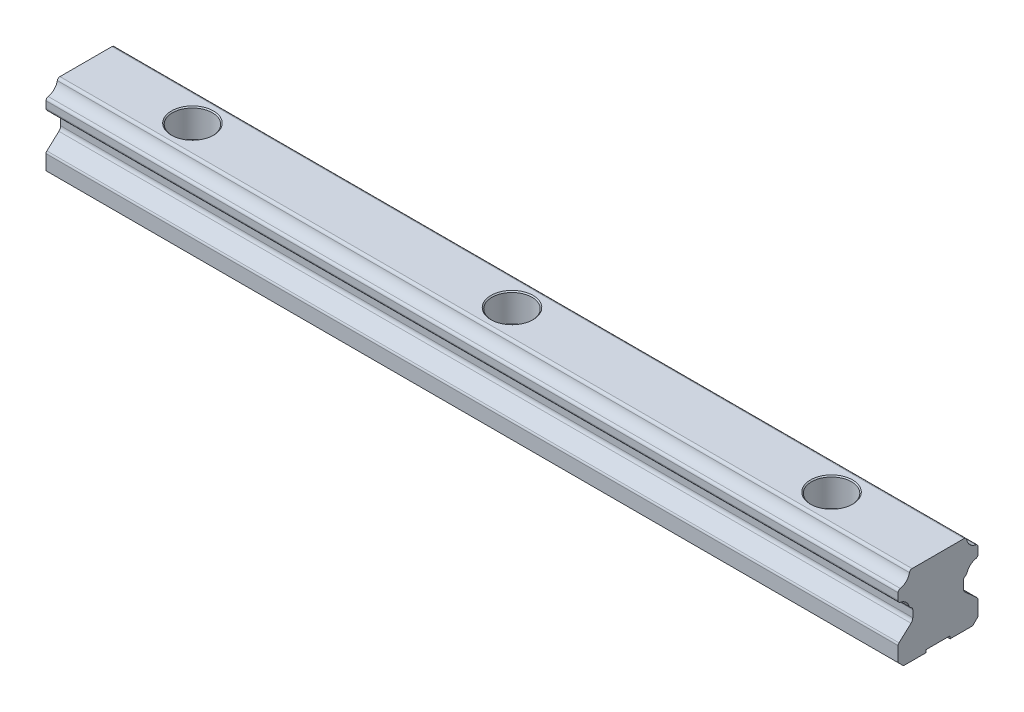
ISO-10303-21;
HEADER;
FILE_DESCRIPTION(('STEP AP214'),'2;1');
FILE_NAME('part.step','',(''),(''),'','','');
FILE_SCHEMA(('AUTOMOTIVE_DESIGN { 1 0 10303 214 1 1 1 1 }'));
ENDSEC;
DATA;
#1=APPLICATION_CONTEXT('core data for automotive mechanical design processes');
#2=APPLICATION_PROTOCOL_DEFINITION('international standard','automotive_design',2000,#1);
#3=PRODUCT_CONTEXT('',#1,'mechanical');
#4=PRODUCT('Part','Part','',(#3));
#5=PRODUCT_RELATED_PRODUCT_CATEGORY('part','',(#4));
#6=PRODUCT_DEFINITION_FORMATION('','',#4);
#7=PRODUCT_DEFINITION_CONTEXT('part definition',#1,'design');
#8=PRODUCT_DEFINITION('design','',#6,#7);
#9=PRODUCT_DEFINITION_SHAPE('','',#8);
#10=(LENGTH_UNIT() NAMED_UNIT(*) SI_UNIT(.MILLI.,.METRE.));
#11=(NAMED_UNIT(*) PLANE_ANGLE_UNIT() SI_UNIT($,.RADIAN.));
#12=(NAMED_UNIT(*) SI_UNIT($,.STERADIAN.) SOLID_ANGLE_UNIT());
#13=UNCERTAINTY_MEASURE_WITH_UNIT(LENGTH_MEASURE(1.E-05),#10,'distance_accuracy_value','');
#14=(GEOMETRIC_REPRESENTATION_CONTEXT(3) GLOBAL_UNCERTAINTY_ASSIGNED_CONTEXT((#13)) GLOBAL_UNIT_ASSIGNED_CONTEXT((#10,
#11,#12)) REPRESENTATION_CONTEXT('',''));
#15=CARTESIAN_POINT('',(0.,0.,0.));
#16=DIRECTION('',(0.,0.,1.));
#17=DIRECTION('',(1.,0.,0.));
#18=AXIS2_PLACEMENT_3D('',#15,#16,#17);
#19=CARTESIAN_POINT('',(160.,0.,-2.25));
#20=DIRECTION('',(0.,0.,1.));
#21=DIRECTION('',(1.,0.,0.));
#22=AXIS2_PLACEMENT_3D('',#19,#20,#21);
#23=PLANE('',#22);
#24=DIRECTION('',(-1.,0.,0.));
#25=VECTOR('',#24,1.);
#26=CARTESIAN_POINT('',(160.,0.5,-2.25));
#27=LINE('',#26,#25);
#28=CARTESIAN_POINT('',(19.8499166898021,0.5,-2.25));
#29=VERTEX_POINT('',#28);
#30=CARTESIAN_POINT('',(0.,0.5,-2.25));
#31=VERTEX_POINT('',#30);
#32=EDGE_CURVE('E11',#29,#31,#27,.T.);
#33=ORIENTED_EDGE('',*,*,#32,.T.);
#34=DIRECTION('',(0.,1.,0.));
#35=VECTOR('',#34,1.);
#36=CARTESIAN_POINT('',(0.,0.,-2.25));
#37=LINE('',#36,#35);
#38=CARTESIAN_POINT('',(0.,0.,-2.25));
#39=VERTEX_POINT('',#38);
#40=EDGE_CURVE('E42',#39,#31,#37,.T.);
#41=ORIENTED_EDGE('',*,*,#40,.F.);
#42=DIRECTION('',(-1.,0.,0.));
#43=VECTOR('',#42,1.);
#44=CARTESIAN_POINT('',(160.,0.,-2.25));
#45=LINE('',#44,#43);
#46=CARTESIAN_POINT('',(19.0178976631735,0.,-2.25));
#47=VERTEX_POINT('',#46);
#48=EDGE_CURVE('E776',#47,#39,#45,.T.);
#49=ORIENTED_EDGE('',*,*,#48,.F.);
#50=CARTESIAN_POINT('',(19.8499166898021,0.200000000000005,-2.25));
#51=CARTESIAN_POINT('',(19.8146878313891,0.19766204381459,-2.24999710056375));
#52=CARTESIAN_POINT('',(19.7795161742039,0.194498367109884,-2.24999427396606));
#53=CARTESIAN_POINT('',(19.7091811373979,0.186558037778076,-2.24999457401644));
#54=CARTESIAN_POINT('',(19.6740186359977,0.181773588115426,-2.24999772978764));
#55=CARTESIAN_POINT('',(19.6035586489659,0.170593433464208,-2.25001604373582));
#56=CARTESIAN_POINT('',(19.5682638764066,0.164180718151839,-2.25003133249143));
#57=CARTESIAN_POINT('',(19.4973967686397,0.149757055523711,-2.25005736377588));
#58=CARTESIAN_POINT('',(19.4618294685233,0.141721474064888,-2.2500680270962));
#59=CARTESIAN_POINT('',(19.3924759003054,0.124592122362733,-2.25006632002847));
#60=CARTESIAN_POINT('',(19.358675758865,0.115554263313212,-2.25005486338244));
#61=CARTESIAN_POINT('',(19.2909668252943,0.096120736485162,-2.25003323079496));
#62=CARTESIAN_POINT('',(19.2570628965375,0.0857081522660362,-2.25002307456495));
#63=CARTESIAN_POINT('',(19.189052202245,0.0635313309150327,-2.25000833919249));
#64=CARTESIAN_POINT('',(19.1549520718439,0.051746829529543,-2.25000385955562));
#65=CARTESIAN_POINT('',(19.0864583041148,0.0268285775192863,-2.24999908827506));
#66=CARTESIAN_POINT('',(19.0520728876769,0.013672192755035,-2.24999888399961));
#67=CARTESIAN_POINT('',(19.0178976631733,5.0301559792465E-13,-2.25000000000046));
#68=B_SPLINE_CURVE_WITH_KNOTS('',3,(#50,#51,#52,#53,#54,#55,#56,#57,#58,#59,#60,#61,#62,#63,#64,
#65,#66,#67),.UNSPECIFIED.,.F.,.F.,(4,2,2,2,2,2,2,2,4),(0.,0.105905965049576,0.212328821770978,
0.319912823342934,0.429272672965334,0.534211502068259,0.640589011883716,0.748806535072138,
0.859233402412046),.UNSPECIFIED.);
#69=CARTESIAN_POINT('',(19.8499166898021,0.2,-2.25));
#70=VERTEX_POINT('',#69);
#71=EDGE_CURVE('E836',#70,#47,#68,.T.);
#72=ORIENTED_EDGE('',*,*,#71,.F.);
#73=DIRECTION('',(0.,-1.,0.));
#74=VECTOR('',#73,1.);
#75=CARTESIAN_POINT('',(19.8499166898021,0.,-2.25));
#76=LINE('',#75,#74);
#77=EDGE_CURVE('E586',#29,#70,#76,.T.);
#78=ORIENTED_EDGE('',*,*,#77,.F.);
#79=EDGE_LOOP('',(#33,#41,#49,#72,#78));
#80=FACE_BOUND('',#79,.T.);
#81=ADVANCED_FACE('F17',(#80),#23,.T.);
#82=CARTESIAN_POINT('',(80.,0.2,0.));
#83=DIRECTION('',(0.,-1.,0.));
#84=DIRECTION('',(0.,0.,-1.));
#85=AXIS2_PLACEMENT_3D('',#82,#83,#84);
#86=CONICAL_SURFACE('',#85,2.255,0.7853981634);
#87=CARTESIAN_POINT('',(80.,0.,0.));
#88=DIRECTION('',(0.,-1.,0.));
#89=DIRECTION('',(0.,0.,-1.));
#90=AXIS2_PLACEMENT_3D('',#87,#88,#89);
#91=CIRCLE('',#90,2.455);
#92=CARTESIAN_POINT('',(80.9821023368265,0.,2.25));
#93=VERTEX_POINT('',#92);
#94=CARTESIAN_POINT('',(79.0178976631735,0.,2.25));
#95=VERTEX_POINT('',#94);
#96=EDGE_CURVE('E28',#93,#95,#91,.T.);
#97=ORIENTED_EDGE('',*,*,#96,.T.);
#98=CARTESIAN_POINT('',(79.0178976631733,5.22016240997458E-13,2.25000000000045));
#99=CARTESIAN_POINT('',(79.0519999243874,0.0136433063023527,2.24999874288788));
#100=CARTESIAN_POINT('',(79.086314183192,0.0267656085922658,2.25000768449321));
#101=CARTESIAN_POINT('',(79.1547311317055,0.0516365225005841,2.25003861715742));
#102=CARTESIAN_POINT('',(79.1888263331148,0.0634057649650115,2.25006036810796));
#103=CARTESIAN_POINT('',(79.2568905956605,0.0855727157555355,2.25010966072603));
#104=CARTESIAN_POINT('',(79.2908537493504,0.0959884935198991,2.2501371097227));
#105=CARTESIAN_POINT('',(79.3587423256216,0.115449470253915,2.25018450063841));
#106=CARTESIAN_POINT('',(79.3926635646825,0.124509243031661,2.25020452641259));
#107=CARTESIAN_POINT('',(79.4622065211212,0.141675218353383,2.25020679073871));
#108=CARTESIAN_POINT('',(79.4978414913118,0.149727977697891,2.25018746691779));
#109=CARTESIAN_POINT('',(79.5687814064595,0.164176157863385,2.25013527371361));
#110=CARTESIAN_POINT('',(79.6040807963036,0.170598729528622,2.25010265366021));
#111=CARTESIAN_POINT('',(79.6744884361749,0.181788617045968,2.25004967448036));
#112=CARTESIAN_POINT('',(79.7095935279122,0.186575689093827,2.25002916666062));
#113=CARTESIAN_POINT('',(79.7797528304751,0.194510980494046,2.25000292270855));
#114=CARTESIAN_POINT('',(79.8148058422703,0.197669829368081,2.24999708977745));
#115=CARTESIAN_POINT('',(79.8499166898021,0.200000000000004,2.25));
#116=B_SPLINE_CURVE_WITH_KNOTS('',3,(#98,#99,#100,#101,#102,#103,#104,#105,#106,#107,#108,#109,
#110,#111,#112,#113,#114,#115),.UNSPECIFIED.,.F.,.F.,(4,2,2,2,2,2,2,2,4),(0.,0.110190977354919,
0.218379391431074,0.324929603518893,0.430236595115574,0.539806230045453,0.647409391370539,
0.753662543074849,0.859212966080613),.UNSPECIFIED.);
#117=CARTESIAN_POINT('',(79.8499166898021,0.2,2.25));
#118=VERTEX_POINT('',#117);
#119=EDGE_CURVE('E958',#95,#118,#116,.T.);
#120=ORIENTED_EDGE('',*,*,#119,.T.);
#121=CARTESIAN_POINT('',(80.,0.2,0.));
#122=DIRECTION('',(0.,-1.,0.));
#123=DIRECTION('',(0.,0.,-1.));
#124=AXIS2_PLACEMENT_3D('',#121,#122,#123);
#125=CIRCLE('',#124,2.255);
#126=CARTESIAN_POINT('',(80.1500833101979,0.2,2.25));
#127=VERTEX_POINT('',#126);
#128=EDGE_CURVE('E1130',#127,#118,#125,.T.);
#129=ORIENTED_EDGE('',*,*,#128,.F.);
#130=CARTESIAN_POINT('',(80.1500833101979,0.200000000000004,2.25));
#131=CARTESIAN_POINT('',(80.1853121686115,0.197662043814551,2.24999710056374));
#132=CARTESIAN_POINT('',(80.2204838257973,0.19449836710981,2.24999427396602));
#133=CARTESIAN_POINT('',(80.2908188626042,0.186558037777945,2.2499945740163));
#134=CARTESIAN_POINT('',(80.3259813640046,0.18177358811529,2.24999772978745));
#135=CARTESIAN_POINT('',(80.3964413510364,0.170593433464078,2.25001604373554));
#136=CARTESIAN_POINT('',(80.4317361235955,0.164180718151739,2.25003133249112));
#137=CARTESIAN_POINT('',(80.5026032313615,0.149757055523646,2.25005736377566));
#138=CARTESIAN_POINT('',(80.5381705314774,0.141721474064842,2.25006802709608));
#139=CARTESIAN_POINT('',(80.6075240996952,0.124592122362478,2.25006632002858));
#140=CARTESIAN_POINT('',(80.6413242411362,0.11555426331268,2.25005486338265));
#141=CARTESIAN_POINT('',(80.7090331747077,0.0961207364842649,2.25003323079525));
#142=CARTESIAN_POINT('',(80.7429371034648,0.0857081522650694,2.25002307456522));
#143=CARTESIAN_POINT('',(80.8109477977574,0.0635313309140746,2.25000833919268));
#144=CARTESIAN_POINT('',(80.8450479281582,0.0517468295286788,2.25000385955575));
#145=CARTESIAN_POINT('',(80.9135416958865,0.0268285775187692,2.24999908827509));
#146=CARTESIAN_POINT('',(80.9479271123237,0.0136721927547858,2.24999888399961));
#147=CARTESIAN_POINT('',(80.9821023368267,5.09005814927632E-13,2.25000000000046));
#148=B_SPLINE_CURVE_WITH_KNOTS('',3,(#130,#131,#132,#133,#134,#135,#136,#137,#138,#139,#140,
#141,#142,#143,#144,#145,#146,#147),.UNSPECIFIED.,.F.,.F.,(4,2,2,2,2,2,2,2,4),(0.,
0.10590596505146,0.2123288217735,0.319912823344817,0.429272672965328,0.534211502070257,
0.640589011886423,0.748806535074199,0.859233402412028),.UNSPECIFIED.);
#149=EDGE_CURVE('E997',#127,#93,#148,.T.);
#150=ORIENTED_EDGE('',*,*,#149,.T.);
#151=EDGE_LOOP('',(#97,#120,#129,#150));
#152=FACE_BOUND('',#151,.T.);
#153=ADVANCED_FACE('F965',(#152),#86,.F.);
#154=CARTESIAN_POINT('',(20.,0.2,0.));
#155=DIRECTION('',(0.,-1.,0.));
#156=DIRECTION('',(0.,0.,-1.));
#157=AXIS2_PLACEMENT_3D('',#154,#155,#156);
#158=CONICAL_SURFACE('',#157,2.255,0.7853981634);
#159=CARTESIAN_POINT('',(20.,0.,0.));
#160=DIRECTION('',(0.,-1.,0.));
#161=DIRECTION('',(0.,0.,-1.));
#162=AXIS2_PLACEMENT_3D('',#159,#160,#161);
#163=CIRCLE('',#162,2.455);
#164=CARTESIAN_POINT('',(20.9821023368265,0.,2.25));
#165=VERTEX_POINT('',#164);
#166=CARTESIAN_POINT('',(19.0178976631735,0.,2.25));
#167=VERTEX_POINT('',#166);
#168=EDGE_CURVE('E1535',#165,#167,#163,.T.);
#169=ORIENTED_EDGE('',*,*,#168,.T.);
#170=CARTESIAN_POINT('',(19.0178976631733,5.19007579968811E-13,2.25000000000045));
#171=CARTESIAN_POINT('',(19.0519999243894,0.013643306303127,2.24999874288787));
#172=CARTESIAN_POINT('',(19.0863141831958,0.026765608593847,2.25000768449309));
#173=CARTESIAN_POINT('',(19.1547311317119,0.0516365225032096,2.25003861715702));
#174=CARTESIAN_POINT('',(19.1888263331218,0.0634057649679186,2.25006036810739));
#175=CARTESIAN_POINT('',(19.2568905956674,0.0855727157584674,2.25010966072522));
#176=CARTESIAN_POINT('',(19.2908537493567,0.0959884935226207,2.25013710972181));
#177=CARTESIAN_POINT('',(19.3587423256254,0.115449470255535,2.25018450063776));
#178=CARTESIAN_POINT('',(19.3926635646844,0.124509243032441,2.25020452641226));
#179=CARTESIAN_POINT('',(19.4622065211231,0.141675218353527,2.25020679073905));
#180=CARTESIAN_POINT('',(19.4978414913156,0.149727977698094,2.25018746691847));
#181=CARTESIAN_POINT('',(19.5687814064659,0.164176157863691,2.25013527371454));
#182=CARTESIAN_POINT('',(19.6040807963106,0.170598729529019,2.25010265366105));
#183=CARTESIAN_POINT('',(19.6744884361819,0.181788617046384,2.25004967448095));
#184=CARTESIAN_POINT('',(19.7095935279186,0.186575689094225,2.25002916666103));
#185=CARTESIAN_POINT('',(19.7797528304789,0.194510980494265,2.25000292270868));
#186=CARTESIAN_POINT('',(19.8148058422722,0.197669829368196,2.24999708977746));
#187=CARTESIAN_POINT('',(19.8499166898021,0.200000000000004,2.25));
#188=B_SPLINE_CURVE_WITH_KNOTS('',3,(#170,#171,#172,#173,#174,#175,#176,#177,#178,#179,#180,
#181,#182,#183,#184,#185,#186,#187),.UNSPECIFIED.,.F.,.F.,(4,2,2,2,2,2,2,2,4),(0.,
0.110190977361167,0.218379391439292,0.324929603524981,0.43023659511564,0.539806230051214,
0.647409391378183,0.753662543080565,0.8592129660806),.UNSPECIFIED.);
#189=CARTESIAN_POINT('',(19.8499166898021,0.2,2.25));
#190=VERTEX_POINT('',#189);
#191=EDGE_CURVE('E1540',#167,#190,#188,.T.);
#192=ORIENTED_EDGE('',*,*,#191,.T.);
#193=CARTESIAN_POINT('',(20.,0.2,0.));
#194=DIRECTION('',(0.,-1.,0.));
#195=DIRECTION('',(0.,0.,-1.));
#196=AXIS2_PLACEMENT_3D('',#193,#194,#195);
#197=CIRCLE('',#196,2.255);
#198=CARTESIAN_POINT('',(20.1500833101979,0.2,2.25));
#199=VERTEX_POINT('',#198);
#200=EDGE_CURVE('E1085',#199,#190,#197,.T.);
#201=ORIENTED_EDGE('',*,*,#200,.F.);
#202=CARTESIAN_POINT('',(20.1500833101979,0.200000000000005,2.25));
#203=CARTESIAN_POINT('',(20.1853121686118,0.197662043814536,2.24999710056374));
#204=CARTESIAN_POINT('',(20.2204838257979,0.194498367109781,2.249994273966));
#205=CARTESIAN_POINT('',(20.2908188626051,0.18655803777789,2.24999457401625));
#206=CARTESIAN_POINT('',(20.3259813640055,0.181773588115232,2.24999772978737));
#207=CARTESIAN_POINT('',(20.3964413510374,0.170593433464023,2.25001604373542));
#208=CARTESIAN_POINT('',(20.4317361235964,0.164180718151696,2.25003133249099));
#209=CARTESIAN_POINT('',(20.5026032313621,0.149757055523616,2.25005736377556));
#210=CARTESIAN_POINT('',(20.5381705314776,0.14172147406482,2.25006802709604));
#211=CARTESIAN_POINT('',(20.6075240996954,0.124592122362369,2.25006632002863));
#212=CARTESIAN_POINT('',(20.6413242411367,0.115554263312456,2.25005486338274));
#213=CARTESIAN_POINT('',(20.7090331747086,0.0961207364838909,2.25003323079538));
#214=CARTESIAN_POINT('',(20.7429371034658,0.0857081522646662,2.25002307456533));
#215=CARTESIAN_POINT('',(20.8109477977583,0.063531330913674,2.25000833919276));
#216=CARTESIAN_POINT('',(20.845047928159,0.051746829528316,2.25000385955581));
#217=CARTESIAN_POINT('',(20.913541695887,0.0268285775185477,2.24999908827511));
#218=CARTESIAN_POINT('',(20.947927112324,0.0136721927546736,2.24999888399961));
#219=CARTESIAN_POINT('',(20.9821023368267,5.0301559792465E-13,2.25000000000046));
#220=B_SPLINE_CURVE_WITH_KNOTS('',3,(#202,#203,#204,#205,#206,#207,#208,#209,#210,#211,#212,
#213,#214,#215,#216,#217,#218,#219),.UNSPECIFIED.,.F.,.F.,(4,2,2,2,2,2,2,2,4),(0.,
0.105905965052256,0.212328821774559,0.319912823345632,0.429272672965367,0.534211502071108,
0.640589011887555,0.74880653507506,0.859233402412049),.UNSPECIFIED.);
#221=EDGE_CURVE('E711',#199,#165,#220,.T.);
#222=ORIENTED_EDGE('',*,*,#221,.T.);
#223=EDGE_LOOP('',(#169,#192,#201,#222));
#224=FACE_BOUND('',#223,.T.);
#225=ADVANCED_FACE('F975',(#224),#158,.F.);
#226=CARTESIAN_POINT('',(20.,0.,0.));
#227=DIRECTION('',(0.,1.,0.));
#228=DIRECTION('',(0.,0.,-1.));
#229=AXIS2_PLACEMENT_3D('',#226,#227,#228);
#230=CYLINDRICAL_SURFACE('',#229,2.255);
#231=CARTESIAN_POINT('',(20.,9.7,0.));
#232=DIRECTION('',(0.,-1.,0.));
#233=DIRECTION('',(0.,0.,-1.));
#234=AXIS2_PLACEMENT_3D('',#231,#232,#233);
#235=CIRCLE('',#234,2.255);
#236=CARTESIAN_POINT('',(20.,9.7,-2.255));
#237=VERTEX_POINT('',#236);
#238=EDGE_CURVE('E719',#237,#237,#235,.T.);
#239=ORIENTED_EDGE('',*,*,#238,.F.);
#240=EDGE_LOOP('',(#239));
#241=FACE_BOUND('',#240,.T.);
#242=CARTESIAN_POINT('',(20.,0.5,0.));
#243=DIRECTION('',(0.,-1.,0.));
#244=DIRECTION('',(0.,0.,-1.));
#245=AXIS2_PLACEMENT_3D('',#242,#243,#244);
#246=CIRCLE('',#245,2.255);
#247=CARTESIAN_POINT('',(20.1500833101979,0.5,-2.25));
#248=VERTEX_POINT('',#247);
#249=CARTESIAN_POINT('',(20.1500833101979,0.5,2.25));
#250=VERTEX_POINT('',#249);
#251=EDGE_CURVE('E707',#248,#250,#246,.T.);
#252=ORIENTED_EDGE('',*,*,#251,.T.);
#253=DIRECTION('',(0.,-1.,0.));
#254=VECTOR('',#253,1.);
#255=CARTESIAN_POINT('',(20.1500833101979,0.,2.25));
#256=LINE('',#255,#254);
#257=EDGE_CURVE('E712',#250,#199,#256,.T.);
#258=ORIENTED_EDGE('',*,*,#257,.T.);
#259=ORIENTED_EDGE('',*,*,#200,.T.);
#260=DIRECTION('',(0.,1.,0.));
#261=VECTOR('',#260,1.);
#262=CARTESIAN_POINT('',(19.8499166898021,0.,2.25));
#263=LINE('',#262,#261);
#264=CARTESIAN_POINT('',(19.8499166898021,0.5,2.25));
#265=VERTEX_POINT('',#264);
#266=EDGE_CURVE('E585',#190,#265,#263,.T.);
#267=ORIENTED_EDGE('',*,*,#266,.T.);
#268=CARTESIAN_POINT('',(20.,0.5,0.));
#269=DIRECTION('',(0.,-1.,0.));
#270=DIRECTION('',(0.,0.,-1.));
#271=AXIS2_PLACEMENT_3D('',#268,#269,#270);
#272=CIRCLE('',#271,2.255);
#273=EDGE_CURVE('E581',#265,#29,#272,.T.);
#274=ORIENTED_EDGE('',*,*,#273,.T.);
#275=ORIENTED_EDGE('',*,*,#77,.T.);
#276=CARTESIAN_POINT('',(20.,0.2,0.));
#277=DIRECTION('',(0.,-1.,0.));
#278=DIRECTION('',(0.,0.,-1.));
#279=AXIS2_PLACEMENT_3D('',#276,#277,#278);
#280=CIRCLE('',#279,2.255);
#281=CARTESIAN_POINT('',(20.1500833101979,0.2,-2.25));
#282=VERTEX_POINT('',#281);
#283=EDGE_CURVE('E1153',#70,#282,#280,.T.);
#284=ORIENTED_EDGE('',*,*,#283,.T.);
#285=DIRECTION('',(0.,1.,0.));
#286=VECTOR('',#285,1.);
#287=CARTESIAN_POINT('',(20.1500833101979,0.,-2.25));
#288=LINE('',#287,#286);
#289=EDGE_CURVE('E723',#282,#248,#288,.T.);
#290=ORIENTED_EDGE('',*,*,#289,.T.);
#291=EDGE_LOOP('',(#252,#258,#259,#267,#274,#275,#284,#290));
#292=FACE_BOUND('',#291,.T.);
#293=ADVANCED_FACE('F1157',(#241,#292),#230,.F.);
#294=CARTESIAN_POINT('',(23.755,9.7,0.));
#295=DIRECTION('',(0.,1.,0.));
#296=DIRECTION('',(1.,0.,0.));
#297=AXIS2_PLACEMENT_3D('',#294,#295,#296);
#298=PLANE('',#297);
#299=CARTESIAN_POINT('',(20.,9.7,0.));
#300=DIRECTION('',(0.,-1.,0.));
#301=DIRECTION('',(0.,0.,-1.));
#302=AXIS2_PLACEMENT_3D('',#299,#300,#301);
#303=CIRCLE('',#302,3.755);
#304=CARTESIAN_POINT('',(20.,9.7,-3.755));
#305=VERTEX_POINT('',#304);
#306=EDGE_CURVE('E685',#305,#305,#303,.T.);
#307=ORIENTED_EDGE('',*,*,#306,.F.);
#308=EDGE_LOOP('',(#307));
#309=FACE_BOUND('',#308,.T.);
#310=ORIENTED_EDGE('',*,*,#238,.T.);
#311=EDGE_LOOP('',(#310));
#312=FACE_BOUND('',#311,.T.);
#313=ADVANCED_FACE('F1641',(#309,#312),#298,.T.);
#314=CARTESIAN_POINT('',(20.,0.,0.));
#315=DIRECTION('',(0.,1.,0.));
#316=DIRECTION('',(0.,0.,-1.));
#317=AXIS2_PLACEMENT_3D('',#314,#315,#316);
#318=CYLINDRICAL_SURFACE('',#317,3.755);
#319=CARTESIAN_POINT('',(20.,14.8,0.));
#320=DIRECTION('',(0.,-1.,0.));
#321=DIRECTION('',(0.,0.,-1.));
#322=AXIS2_PLACEMENT_3D('',#319,#320,#321);
#323=CIRCLE('',#322,3.755);
#324=CARTESIAN_POINT('',(20.,14.8,-3.755));
#325=VERTEX_POINT('',#324);
#326=EDGE_CURVE('E681',#325,#325,#323,.T.);
#327=ORIENTED_EDGE('',*,*,#326,.F.);
#328=EDGE_LOOP('',(#327));
#329=FACE_BOUND('',#328,.T.);
#330=ORIENTED_EDGE('',*,*,#306,.T.);
#331=EDGE_LOOP('',(#330));
#332=FACE_BOUND('',#331,.T.);
#333=ADVANCED_FACE('F1580',(#329,#332),#318,.F.);
#334=CARTESIAN_POINT('',(20.,15.,0.));
#335=DIRECTION('',(0.,1.,0.));
#336=DIRECTION('',(0.,0.,1.));
#337=AXIS2_PLACEMENT_3D('',#334,#335,#336);
#338=CONICAL_SURFACE('',#337,3.955,0.7853981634);
#339=CARTESIAN_POINT('',(20.,15.,0.));
#340=DIRECTION('',(0.,-1.,0.));
#341=DIRECTION('',(0.,0.,-1.));
#342=AXIS2_PLACEMENT_3D('',#339,#340,#341);
#343=CIRCLE('',#342,3.955);
#344=CARTESIAN_POINT('',(20.,15.,-3.955));
#345=VERTEX_POINT('',#344);
#346=EDGE_CURVE('E629',#345,#345,#343,.T.);
#347=ORIENTED_EDGE('',*,*,#346,.F.);
#348=EDGE_LOOP('',(#347));
#349=FACE_BOUND('',#348,.T.);
#350=ORIENTED_EDGE('',*,*,#326,.T.);
#351=EDGE_LOOP('',(#350));
#352=FACE_BOUND('',#351,.T.);
#353=ADVANCED_FACE('F1960',(#349,#352),#338,.F.);
#354=CARTESIAN_POINT('',(143.755,9.7,0.));
#355=DIRECTION('',(0.,1.,0.));
#356=DIRECTION('',(1.,0.,0.));
#357=AXIS2_PLACEMENT_3D('',#354,#355,#356);
#358=PLANE('',#357);
#359=CARTESIAN_POINT('',(140.,9.7,0.));
#360=DIRECTION('',(0.,-1.,0.));
#361=DIRECTION('',(0.,0.,-1.));
#362=AXIS2_PLACEMENT_3D('',#359,#360,#361);
#363=CIRCLE('',#362,3.755);
#364=CARTESIAN_POINT('',(140.,9.7,-3.755));
#365=VERTEX_POINT('',#364);
#366=EDGE_CURVE('E947',#365,#365,#363,.T.);
#367=ORIENTED_EDGE('',*,*,#366,.F.);
#368=EDGE_LOOP('',(#367));
#369=FACE_BOUND('',#368,.T.);
#370=CARTESIAN_POINT('',(140.,9.7,0.));
#371=DIRECTION('',(0.,-1.,0.));
#372=DIRECTION('',(0.,0.,-1.));
#373=AXIS2_PLACEMENT_3D('',#370,#371,#372);
#374=CIRCLE('',#373,2.255);
#375=CARTESIAN_POINT('',(140.,9.7,-2.255));
#376=VERTEX_POINT('',#375);
#377=EDGE_CURVE('E686',#376,#376,#374,.T.);
#378=ORIENTED_EDGE('',*,*,#377,.T.);
#379=EDGE_LOOP('',(#378));
#380=FACE_BOUND('',#379,.T.);
#381=ADVANCED_FACE('F19',(#369,#380),#358,.T.);
#382=CARTESIAN_POINT('',(160.,0.,6.5));
#383=DIRECTION('',(0.,1.,0.));
#384=DIRECTION('',(1.,0.,0.));
#385=AXIS2_PLACEMENT_3D('',#382,#383,#384);
#386=PLANE('',#385);
#387=DIRECTION('',(-1.,0.,0.));
#388=VECTOR('',#387,1.);
#389=CARTESIAN_POINT('',(160.,0.,2.25));
#390=LINE('',#389,#388);
#391=CARTESIAN_POINT('',(160.,0.,2.25));
#392=VERTEX_POINT('',#391);
#393=CARTESIAN_POINT('',(140.982102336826,0.,2.25));
#394=VERTEX_POINT('',#393);
#395=EDGE_CURVE('E598',#392,#394,#390,.T.);
#396=ORIENTED_EDGE('',*,*,#395,.F.);
#397=DIRECTION('',(0.,0.,-1.));
#398=VECTOR('',#397,1.);
#399=CARTESIAN_POINT('',(160.,0.,6.5));
#400=LINE('',#399,#398);
#401=CARTESIAN_POINT('',(160.,0.,6.5));
#402=VERTEX_POINT('',#401);
#403=EDGE_CURVE('E579',#402,#392,#400,.T.);
#404=ORIENTED_EDGE('',*,*,#403,.F.);
#405=DIRECTION('',(-1.,0.,0.));
#406=VECTOR('',#405,1.);
#407=CARTESIAN_POINT('',(160.,0.,6.5));
#408=LINE('',#407,#406);
#409=CARTESIAN_POINT('',(0.,0.,6.5));
#410=VERTEX_POINT('',#409);
#411=EDGE_CURVE('E762',#402,#410,#408,.T.);
#412=ORIENTED_EDGE('',*,*,#411,.T.);
#413=DIRECTION('',(0.,0.,-1.));
#414=VECTOR('',#413,1.);
#415=CARTESIAN_POINT('',(0.,0.,6.5));
#416=LINE('',#415,#414);
#417=CARTESIAN_POINT('',(0.,0.,2.25));
#418=VERTEX_POINT('',#417);
#419=EDGE_CURVE('E766',#410,#418,#416,.T.);
#420=ORIENTED_EDGE('',*,*,#419,.T.);
#421=DIRECTION('',(-1.,0.,0.));
#422=VECTOR('',#421,1.);
#423=CARTESIAN_POINT('',(160.,0.,2.25));
#424=LINE('',#423,#422);
#425=EDGE_CURVE('E932',#167,#418,#424,.T.);
#426=ORIENTED_EDGE('',*,*,#425,.F.);
#427=ORIENTED_EDGE('',*,*,#168,.F.);
#428=DIRECTION('',(-1.,0.,0.));
#429=VECTOR('',#428,1.);
#430=CARTESIAN_POINT('',(160.,0.,2.25));
#431=LINE('',#430,#429);
#432=EDGE_CURVE('E1123',#95,#165,#431,.T.);
#433=ORIENTED_EDGE('',*,*,#432,.F.);
#434=ORIENTED_EDGE('',*,*,#96,.F.);
#435=DIRECTION('',(-1.,0.,0.));
#436=VECTOR('',#435,1.);
#437=CARTESIAN_POINT('',(160.,0.,2.25));
#438=LINE('',#437,#436);
#439=CARTESIAN_POINT('',(139.017897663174,0.,2.25));
#440=VERTEX_POINT('',#439);
#441=EDGE_CURVE('E648',#440,#93,#438,.T.);
#442=ORIENTED_EDGE('',*,*,#441,.F.);
#443=CARTESIAN_POINT('',(140.,0.,0.));
#444=DIRECTION('',(0.,-1.,0.));
#445=DIRECTION('',(0.,0.,-1.));
#446=AXIS2_PLACEMENT_3D('',#443,#444,#445);
#447=CIRCLE('',#446,2.455);
#448=EDGE_CURVE('E697',#394,#440,#447,.T.);
#449=ORIENTED_EDGE('',*,*,#448,.F.);
#450=EDGE_LOOP('',(#396,#404,#412,#420,#426,#427,#433,#434,#442,#449));
#451=FACE_BOUND('',#450,.T.);
#452=ADVANCED_FACE('F1690',(#451),#386,.F.);
#453=CARTESIAN_POINT('',(160.,0.,6.5));
#454=DIRECTION('',(0.,1.,0.));
#455=DIRECTION('',(1.,0.,0.));
#456=AXIS2_PLACEMENT_3D('',#453,#454,#455);
#457=PLANE('',#456);
#458=ORIENTED_EDGE('',*,*,#48,.T.);
#459=DIRECTION('',(0.,0.,-1.));
#460=VECTOR('',#459,1.);
#461=CARTESIAN_POINT('',(0.,0.,6.5));
#462=LINE('',#461,#460);
#463=CARTESIAN_POINT('',(0.,0.,-6.5));
#464=VERTEX_POINT('',#463);
#465=EDGE_CURVE('E777',#39,#464,#462,.T.);
#466=ORIENTED_EDGE('',*,*,#465,.T.);
#467=DIRECTION('',(-1.,0.,0.));
#468=VECTOR('',#467,1.);
#469=CARTESIAN_POINT('',(160.,0.,-6.5));
#470=LINE('',#469,#468);
#471=CARTESIAN_POINT('',(160.,0.,-6.5));
#472=VERTEX_POINT('',#471);
#473=EDGE_CURVE('E821',#472,#464,#470,.T.);
#474=ORIENTED_EDGE('',*,*,#473,.F.);
#475=DIRECTION('',(0.,0.,-1.));
#476=VECTOR('',#475,1.);
#477=CARTESIAN_POINT('',(160.,0.,6.5));
#478=LINE('',#477,#476);
#479=CARTESIAN_POINT('',(160.,0.,-2.25));
#480=VERTEX_POINT('',#479);
#481=EDGE_CURVE('E575',#480,#472,#478,.T.);
#482=ORIENTED_EDGE('',*,*,#481,.F.);
#483=DIRECTION('',(-1.,0.,0.));
#484=VECTOR('',#483,1.);
#485=CARTESIAN_POINT('',(160.,0.,-2.25));
#486=LINE('',#485,#484);
#487=CARTESIAN_POINT('',(140.982102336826,0.,-2.25));
#488=VERTEX_POINT('',#487);
#489=EDGE_CURVE('E781',#480,#488,#486,.T.);
#490=ORIENTED_EDGE('',*,*,#489,.T.);
#491=CARTESIAN_POINT('',(140.,0.,0.));
#492=DIRECTION('',(0.,-1.,0.));
#493=DIRECTION('',(0.,0.,-1.));
#494=AXIS2_PLACEMENT_3D('',#491,#492,#493);
#495=CIRCLE('',#494,2.455);
#496=CARTESIAN_POINT('',(139.017897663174,0.,-2.25));
#497=VERTEX_POINT('',#496);
#498=EDGE_CURVE('E1766',#497,#488,#495,.T.);
#499=ORIENTED_EDGE('',*,*,#498,.F.);
#500=DIRECTION('',(-1.,0.,0.));
#501=VECTOR('',#500,1.);
#502=CARTESIAN_POINT('',(160.,0.,-2.25));
#503=LINE('',#502,#501);
#504=CARTESIAN_POINT('',(80.9821023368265,0.,-2.25));
#505=VERTEX_POINT('',#504);
#506=EDGE_CURVE('E1445',#497,#505,#503,.T.);
#507=ORIENTED_EDGE('',*,*,#506,.T.);
#508=CARTESIAN_POINT('',(80.,0.,0.));
#509=DIRECTION('',(0.,-1.,0.));
#510=DIRECTION('',(0.,0.,-1.));
#511=AXIS2_PLACEMENT_3D('',#508,#509,#510);
#512=CIRCLE('',#511,2.455);
#513=CARTESIAN_POINT('',(79.0178976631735,0.,-2.25));
#514=VERTEX_POINT('',#513);
#515=EDGE_CURVE('E1742',#514,#505,#512,.T.);
#516=ORIENTED_EDGE('',*,*,#515,.F.);
#517=DIRECTION('',(-1.,0.,0.));
#518=VECTOR('',#517,1.);
#519=CARTESIAN_POINT('',(160.,0.,-2.25));
#520=LINE('',#519,#518);
#521=CARTESIAN_POINT('',(20.9821023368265,0.,-2.25));
#522=VERTEX_POINT('',#521);
#523=EDGE_CURVE('E1448',#514,#522,#520,.T.);
#524=ORIENTED_EDGE('',*,*,#523,.T.);
#525=CARTESIAN_POINT('',(20.,0.,0.));
#526=DIRECTION('',(0.,-1.,0.));
#527=DIRECTION('',(0.,0.,-1.));
#528=AXIS2_PLACEMENT_3D('',#525,#526,#527);
#529=CIRCLE('',#528,2.455);
#530=EDGE_CURVE('E1127',#47,#522,#529,.T.);
#531=ORIENTED_EDGE('',*,*,#530,.F.);
#532=EDGE_LOOP('',(#458,#466,#474,#482,#490,#499,#507,#516,#524,#531));
#533=FACE_BOUND('',#532,.T.);
#534=ADVANCED_FACE('F1500',(#533),#457,.F.);
#535=CARTESIAN_POINT('',(160.,1.,7.5));
#536=DIRECTION('',(0.,0.707106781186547,-0.707106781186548));
#537=DIRECTION('',(-1.,0.,0.));
#538=AXIS2_PLACEMENT_3D('',#535,#536,#537);
#539=PLANE('',#538);
#540=DIRECTION('',(0.,-0.707106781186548,-0.707106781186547));
#541=VECTOR('',#540,1.);
#542=CARTESIAN_POINT('',(0.,1.,7.5));
#543=LINE('',#542,#541);
#544=CARTESIAN_POINT('',(0.,1.,7.5));
#545=VERTEX_POINT('',#544);
#546=EDGE_CURVE('E574',#545,#410,#543,.T.);
#547=ORIENTED_EDGE('',*,*,#546,.T.);
#548=ORIENTED_EDGE('',*,*,#411,.F.);
#549=DIRECTION('',(0.,-0.707106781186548,-0.707106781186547));
#550=VECTOR('',#549,1.);
#551=CARTESIAN_POINT('',(160.,1.,7.5));
#552=LINE('',#551,#550);
#553=CARTESIAN_POINT('',(160.,1.,7.5));
#554=VERTEX_POINT('',#553);
#555=EDGE_CURVE('E902',#554,#402,#552,.T.);
#556=ORIENTED_EDGE('',*,*,#555,.F.);
#557=DIRECTION('',(-1.,0.,0.));
#558=VECTOR('',#557,1.);
#559=CARTESIAN_POINT('',(160.,1.,7.5));
#560=LINE('',#559,#558);
#561=EDGE_CURVE('E571',#554,#545,#560,.T.);
#562=ORIENTED_EDGE('',*,*,#561,.T.);
#563=EDGE_LOOP('',(#547,#548,#556,#562));
#564=FACE_BOUND('',#563,.T.);
#565=ADVANCED_FACE('F1216',(#564),#539,.F.);
#566=CARTESIAN_POINT('',(160.,3.77881505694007,7.5));
#567=DIRECTION('',(0.,0.,-1.));
#568=DIRECTION('',(0.,-1.,0.));
#569=AXIS2_PLACEMENT_3D('',#566,#567,#568);
#570=PLANE('',#569);
#571=DIRECTION('',(0.,-1.,0.));
#572=VECTOR('',#571,1.);
#573=CARTESIAN_POINT('',(0.,3.77881505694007,7.5));
#574=LINE('',#573,#572);
#575=CARTESIAN_POINT('',(0.,3.77881505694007,7.5));
#576=VERTEX_POINT('',#575);
#577=EDGE_CURVE('E552',#576,#545,#574,.T.);
#578=ORIENTED_EDGE('',*,*,#577,.T.);
#579=ORIENTED_EDGE('',*,*,#561,.F.);
#580=DIRECTION('',(0.,-1.,0.));
#581=VECTOR('',#580,1.);
#582=CARTESIAN_POINT('',(160.,3.77881505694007,7.5));
#583=LINE('',#582,#581);
#584=CARTESIAN_POINT('',(160.,3.77881505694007,7.5));
#585=VERTEX_POINT('',#584);
#586=EDGE_CURVE('E750',#585,#554,#583,.T.);
#587=ORIENTED_EDGE('',*,*,#586,.F.);
#588=DIRECTION('',(-1.,0.,0.));
#589=VECTOR('',#588,1.);
#590=CARTESIAN_POINT('',(160.,3.77881505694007,7.5));
#591=LINE('',#590,#589);
#592=EDGE_CURVE('E849',#585,#576,#591,.T.);
#593=ORIENTED_EDGE('',*,*,#592,.T.);
#594=EDGE_LOOP('',(#578,#579,#587,#593));
#595=FACE_BOUND('',#594,.T.);
#596=ADVANCED_FACE('F1108',(#595),#570,.F.);
#597=CARTESIAN_POINT('',(160.,3.77881505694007,7.));
#598=DIRECTION('',(1.,0.,0.));
#599=DIRECTION('',(0.,0.,1.));
#600=AXIS2_PLACEMENT_3D('',#597,#598,#599);
#601=CYLINDRICAL_SURFACE('',#600,0.5);
#602=CARTESIAN_POINT('',(0.,3.77881505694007,7.));
#603=DIRECTION('',(1.,0.,0.));
#604=DIRECTION('',(0.,0.,-1.));
#605=AXIS2_PLACEMENT_3D('',#602,#603,#604);
#606=CIRCLE('',#605,0.5);
#607=CARTESIAN_POINT('',(0.,4.14878509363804,7.33633639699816));
#608=VERTEX_POINT('',#607);
#609=EDGE_CURVE('E796',#608,#576,#606,.T.);
#610=ORIENTED_EDGE('',*,*,#609,.T.);
#611=ORIENTED_EDGE('',*,*,#592,.F.);
#612=CARTESIAN_POINT('',(160.,3.77881505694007,7.));
#613=DIRECTION('',(1.,0.,0.));
#614=DIRECTION('',(0.,0.,-1.));
#615=AXIS2_PLACEMENT_3D('',#612,#613,#614);
#616=CIRCLE('',#615,0.5);
#617=CARTESIAN_POINT('',(160.,4.14878509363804,7.33633639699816));
#618=VERTEX_POINT('',#617);
#619=EDGE_CURVE('E746',#618,#585,#616,.T.);
#620=ORIENTED_EDGE('',*,*,#619,.F.);
#621=DIRECTION('',(-1.,0.,0.));
#622=VECTOR('',#621,1.);
#623=CARTESIAN_POINT('',(160.,4.14878509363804,7.33633639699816));
#624=LINE('',#623,#622);
#625=EDGE_CURVE('E734',#618,#608,#624,.T.);
#626=ORIENTED_EDGE('',*,*,#625,.T.);
#627=EDGE_LOOP('',(#610,#611,#620,#626));
#628=FACE_BOUND('',#627,.T.);
#629=ADVANCED_FACE('F1310',(#628),#601,.T.);
#630=CARTESIAN_POINT('',(160.,6.20242981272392,5.07732720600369));
#631=DIRECTION('',(0.,-0.739940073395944,-0.672672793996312));
#632=DIRECTION('',(0.,0.672672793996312,-0.739940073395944));
#633=AXIS2_PLACEMENT_3D('',#630,#631,#632);
#634=PLANE('',#633);
#635=DIRECTION('',(0.,-0.672672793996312,0.739940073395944));
#636=VECTOR('',#635,1.);
#637=CARTESIAN_POINT('',(0.,6.20242981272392,5.07732720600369));
#638=LINE('',#637,#636);
#639=CARTESIAN_POINT('',(0.,6.20242981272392,5.07732720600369));
#640=VERTEX_POINT('',#639);
#641=EDGE_CURVE('E730',#640,#608,#638,.T.);
#642=ORIENTED_EDGE('',*,*,#641,.T.);
#643=ORIENTED_EDGE('',*,*,#625,.F.);
#644=DIRECTION('',(0.,-0.672672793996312,0.739940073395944));
#645=VECTOR('',#644,1.);
#646=CARTESIAN_POINT('',(160.,6.20242981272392,5.07732720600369));
#647=LINE('',#646,#645);
#648=CARTESIAN_POINT('',(160.,6.20242981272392,5.07732720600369));
#649=VERTEX_POINT('',#648);
#650=EDGE_CURVE('E610',#649,#618,#647,.T.);
#651=ORIENTED_EDGE('',*,*,#650,.F.);
#652=DIRECTION('',(-1.,0.,0.));
#653=VECTOR('',#652,1.);
#654=CARTESIAN_POINT('',(160.,6.20242981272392,5.07732720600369));
#655=LINE('',#654,#653);
#656=EDGE_CURVE('E653',#649,#640,#655,.T.);
#657=ORIENTED_EDGE('',*,*,#656,.T.);
#658=EDGE_LOOP('',(#642,#643,#651,#657));
#659=FACE_BOUND('',#658,.T.);
#660=ADVANCED_FACE('F1317',(#659),#634,.F.);
#661=CARTESIAN_POINT('',(160.,6.94236988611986,5.75));
#662=DIRECTION('',(1.,0.,0.));
#663=DIRECTION('',(0.,0.,1.));
#664=AXIS2_PLACEMENT_3D('',#661,#662,#663);
#665=CYLINDRICAL_SURFACE('',#664,1.);
#666=CARTESIAN_POINT('',(0.,6.94236988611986,5.75));
#667=DIRECTION('',(1.,0.,0.));
#668=DIRECTION('',(0.,0.,-1.));
#669=AXIS2_PLACEMENT_3D('',#666,#667,#668);
#670=CIRCLE('',#669,1.);
#671=CARTESIAN_POINT('',(0.,6.94236988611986,4.75));
#672=VERTEX_POINT('',#671);
#673=EDGE_CURVE('E620',#640,#672,#670,.T.);
#674=ORIENTED_EDGE('',*,*,#673,.F.);
#675=ORIENTED_EDGE('',*,*,#656,.F.);
#676=CARTESIAN_POINT('',(160.,6.94236988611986,5.75));
#677=DIRECTION('',(1.,0.,0.));
#678=DIRECTION('',(0.,0.,-1.));
#679=AXIS2_PLACEMENT_3D('',#676,#677,#678);
#680=CIRCLE('',#679,1.);
#681=CARTESIAN_POINT('',(160.,6.94236988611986,4.75));
#682=VERTEX_POINT('',#681);
#683=EDGE_CURVE('E649',#649,#682,#680,.T.);
#684=ORIENTED_EDGE('',*,*,#683,.T.);
#685=DIRECTION('',(-1.,0.,0.));
#686=VECTOR('',#685,1.);
#687=CARTESIAN_POINT('',(160.,6.94236988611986,4.75));
#688=LINE('',#687,#686);
#689=EDGE_CURVE('E654',#682,#672,#688,.T.);
#690=ORIENTED_EDGE('',*,*,#689,.T.);
#691=EDGE_LOOP('',(#674,#675,#684,#690));
#692=FACE_BOUND('',#691,.T.);
#693=ADVANCED_FACE('F1321',(#692),#665,.F.);
#694=CARTESIAN_POINT('',(160.,8.25739540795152,4.75));
#695=DIRECTION('',(0.,0.,-1.));
#696=DIRECTION('',(0.,-1.,0.));
#697=AXIS2_PLACEMENT_3D('',#694,#695,#696);
#698=PLANE('',#697);
#699=DIRECTION('',(0.,-1.,0.));
#700=VECTOR('',#699,1.);
#701=CARTESIAN_POINT('',(0.,8.25739540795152,4.75));
#702=LINE('',#701,#700);
#703=CARTESIAN_POINT('',(0.,8.25739540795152,4.75));
#704=VERTEX_POINT('',#703);
#705=EDGE_CURVE('E667',#704,#672,#702,.T.);
#706=ORIENTED_EDGE('',*,*,#705,.T.);
#707=ORIENTED_EDGE('',*,*,#689,.F.);
#708=DIRECTION('',(0.,-1.,0.));
#709=VECTOR('',#708,1.);
#710=CARTESIAN_POINT('',(160.,8.25739540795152,4.75));
#711=LINE('',#710,#709);
#712=CARTESIAN_POINT('',(160.,8.25739540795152,4.75));
#713=VERTEX_POINT('',#712);
#714=EDGE_CURVE('E605',#713,#682,#711,.T.);
#715=ORIENTED_EDGE('',*,*,#714,.F.);
#716=DIRECTION('',(-1.,0.,0.));
#717=VECTOR('',#716,1.);
#718=CARTESIAN_POINT('',(160.,8.25739540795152,4.75));
#719=LINE('',#718,#717);
#720=EDGE_CURVE('E671',#713,#704,#719,.T.);
#721=ORIENTED_EDGE('',*,*,#720,.T.);
#722=EDGE_LOOP('',(#706,#707,#715,#721));
#723=FACE_BOUND('',#722,.T.);
#724=ADVANCED_FACE('F1231',(#723),#698,.F.);
#725=CARTESIAN_POINT('',(160.,8.25739540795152,5.25));
#726=DIRECTION('',(1.,0.,0.));
#727=DIRECTION('',(0.,0.,1.));
#728=AXIS2_PLACEMENT_3D('',#725,#726,#727);
#729=CYLINDRICAL_SURFACE('',#728,0.5);
#730=CARTESIAN_POINT('',(0.,8.25739540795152,5.25));
#731=DIRECTION('',(1.,0.,0.));
#732=DIRECTION('',(0.,0.,-1.));
#733=AXIS2_PLACEMENT_3D('',#730,#731,#732);
#734=CIRCLE('',#733,0.5);
#735=CARTESIAN_POINT('',(0.,8.65014124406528,4.94056388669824));
#736=VERTEX_POINT('',#735);
#737=EDGE_CURVE('E624',#704,#736,#734,.T.);
#738=ORIENTED_EDGE('',*,*,#737,.F.);
#739=ORIENTED_EDGE('',*,*,#720,.F.);
#740=CARTESIAN_POINT('',(160.,8.25739540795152,5.25));
#741=DIRECTION('',(1.,0.,0.));
#742=DIRECTION('',(0.,0.,-1.));
#743=AXIS2_PLACEMENT_3D('',#740,#741,#742);
#744=CIRCLE('',#743,0.5);
#745=CARTESIAN_POINT('',(160.,8.65014124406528,4.94056388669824));
#746=VERTEX_POINT('',#745);
#747=EDGE_CURVE('E800',#713,#746,#744,.T.);
#748=ORIENTED_EDGE('',*,*,#747,.T.);
#749=DIRECTION('',(-1.,0.,0.));
#750=VECTOR('',#749,1.);
#751=CARTESIAN_POINT('',(160.,8.65014124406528,4.94056388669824));
#752=LINE('',#751,#750);
#753=EDGE_CURVE('E771',#746,#736,#752,.T.);
#754=ORIENTED_EDGE('',*,*,#753,.T.);
#755=EDGE_LOOP('',(#738,#739,#748,#754));
#756=FACE_BOUND('',#755,.T.);
#757=ADVANCED_FACE('F1221',(#756),#729,.F.);
#758=CARTESIAN_POINT('',(160.,8.90589163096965,5.26517014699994));
#759=DIRECTION('',(0.,0.785491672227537,-0.618872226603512));
#760=DIRECTION('',(-1.,0.,0.));
#761=AXIS2_PLACEMENT_3D('',#758,#759,#760);
#762=PLANE('',#761);
#763=DIRECTION('',(0.,-0.618872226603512,-0.785491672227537));
#764=VECTOR('',#763,1.);
#765=CARTESIAN_POINT('',(0.,8.90589163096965,5.26517014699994));
#766=LINE('',#765,#764);
#767=CARTESIAN_POINT('',(0.,8.90589163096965,5.26517014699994));
#768=VERTEX_POINT('',#767);
#769=EDGE_CURVE('E767',#768,#736,#766,.T.);
#770=ORIENTED_EDGE('',*,*,#769,.T.);
#771=ORIENTED_EDGE('',*,*,#753,.F.);
#772=DIRECTION('',(0.,-0.618872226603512,-0.785491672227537));
#773=VECTOR('',#772,1.);
#774=CARTESIAN_POINT('',(160.,8.90589163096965,5.26517014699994));
#775=LINE('',#774,#773);
#776=CARTESIAN_POINT('',(160.,8.90589163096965,5.26517014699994));
#777=VERTEX_POINT('',#776);
#778=EDGE_CURVE('E609',#777,#746,#775,.T.);
#779=ORIENTED_EDGE('',*,*,#778,.F.);
#780=DIRECTION('',(-1.,0.,0.));
#781=VECTOR('',#780,1.);
#782=CARTESIAN_POINT('',(160.,8.90589163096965,5.26517014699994));
#783=LINE('',#782,#781);
#784=EDGE_CURVE('E772',#777,#768,#783,.T.);
#785=ORIENTED_EDGE('',*,*,#784,.T.);
#786=EDGE_LOOP('',(#770,#771,#779,#785));
#787=FACE_BOUND('',#786,.T.);
#788=ADVANCED_FACE('F1218',(#787),#762,.F.);
#789=CARTESIAN_POINT('',(160.,9.29863746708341,4.9557340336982));
#790=DIRECTION('',(1.,0.,0.));
#791=DIRECTION('',(0.,0.,1.));
#792=AXIS2_PLACEMENT_3D('',#789,#790,#791);
#793=CYLINDRICAL_SURFACE('',#792,0.5);
#794=CARTESIAN_POINT('',(0.,9.29863746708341,4.9557340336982));
#795=DIRECTION('',(1.,0.,0.));
#796=DIRECTION('',(0.,0.,-1.));
#797=AXIS2_PLACEMENT_3D('',#794,#795,#796);
#798=CIRCLE('',#797,0.5);
#799=CARTESIAN_POINT('',(0.,9.14889294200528,5.43278390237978));
#800=VERTEX_POINT('',#799);
#801=EDGE_CURVE('E788',#800,#768,#798,.T.);
#802=ORIENTED_EDGE('',*,*,#801,.T.);
#803=ORIENTED_EDGE('',*,*,#784,.F.);
#804=CARTESIAN_POINT('',(160.,9.29863746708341,4.9557340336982));
#805=DIRECTION('',(1.,0.,0.));
#806=DIRECTION('',(0.,0.,-1.));
#807=AXIS2_PLACEMENT_3D('',#804,#805,#806);
#808=CIRCLE('',#807,0.5);
#809=CARTESIAN_POINT('',(160.,9.14889294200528,5.43278390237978));
#810=VERTEX_POINT('',#809);
#811=EDGE_CURVE('E611',#810,#777,#808,.T.);
#812=ORIENTED_EDGE('',*,*,#811,.F.);
#813=DIRECTION('',(-1.,0.,0.));
#814=VECTOR('',#813,1.);
#815=CARTESIAN_POINT('',(160.,9.14889294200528,5.43278390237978));
#816=LINE('',#815,#814);
#817=EDGE_CURVE('E791',#810,#800,#816,.T.);
#818=ORIENTED_EDGE('',*,*,#817,.T.);
#819=EDGE_LOOP('',(#802,#803,#812,#818));
#820=FACE_BOUND('',#819,.T.);
#821=ADVANCED_FACE('F1220',(#820),#793,.T.);
#822=CARTESIAN_POINT('',(160.,8.5,7.5));
#823=DIRECTION('',(1.,0.,0.));
#824=DIRECTION('',(0.,0.,1.));
#825=AXIS2_PLACEMENT_3D('',#822,#823,#824);
#826=CYLINDRICAL_SURFACE('',#825,2.1666666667);
#827=CARTESIAN_POINT('',(0.,8.5,7.5));
#828=DIRECTION('',(1.,0.,0.));
#829=DIRECTION('',(0.,0.,-1.));
#830=AXIS2_PLACEMENT_3D('',#827,#828,#829);
#831=CIRCLE('',#830,2.1666666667);
#832=CARTESIAN_POINT('',(0.,10.6282399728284,7.09375));
#833=VERTEX_POINT('',#832);
#834=EDGE_CURVE('E1245',#800,#833,#831,.T.);
#835=ORIENTED_EDGE('',*,*,#834,.F.);
#836=ORIENTED_EDGE('',*,*,#817,.F.);
#837=CARTESIAN_POINT('',(160.,8.5,7.5));
#838=DIRECTION('',(1.,0.,0.));
#839=DIRECTION('',(0.,0.,-1.));
#840=AXIS2_PLACEMENT_3D('',#837,#838,#839);
#841=CIRCLE('',#840,2.1666666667);
#842=CARTESIAN_POINT('',(160.,10.6282399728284,7.09375));
#843=VERTEX_POINT('',#842);
#844=EDGE_CURVE('E665',#810,#843,#841,.T.);
#845=ORIENTED_EDGE('',*,*,#844,.T.);
#846=DIRECTION('',(-1.,0.,0.));
#847=VECTOR('',#846,1.);
#848=CARTESIAN_POINT('',(160.,10.6282399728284,7.09375));
#849=LINE('',#848,#847);
#850=EDGE_CURVE('E661',#843,#833,#849,.T.);
#851=ORIENTED_EDGE('',*,*,#850,.T.);
#852=EDGE_LOOP('',(#835,#836,#845,#851));
#853=FACE_BOUND('',#852,.T.);
#854=ADVANCED_FACE('F1186',(#853),#826,.F.);
#855=CARTESIAN_POINT('',(160.,11.1193722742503,7.));
#856=DIRECTION('',(1.,0.,0.));
#857=DIRECTION('',(0.,0.,1.));
#858=AXIS2_PLACEMENT_3D('',#855,#856,#857);
#859=CYLINDRICAL_SURFACE('',#858,0.5);
#860=CARTESIAN_POINT('',(0.,11.1193722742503,7.));
#861=DIRECTION('',(1.,0.,0.));
#862=DIRECTION('',(0.,0.,-1.));
#863=AXIS2_PLACEMENT_3D('',#860,#861,#862);
#864=CIRCLE('',#863,0.5);
#865=CARTESIAN_POINT('',(0.,11.1193722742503,7.5));
#866=VERTEX_POINT('',#865);
#867=EDGE_CURVE('E666',#866,#833,#864,.T.);
#868=ORIENTED_EDGE('',*,*,#867,.T.);
#869=ORIENTED_EDGE('',*,*,#850,.F.);
#870=CARTESIAN_POINT('',(160.,11.1193722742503,7.));
#871=DIRECTION('',(1.,0.,0.));
#872=DIRECTION('',(0.,0.,-1.));
#873=AXIS2_PLACEMENT_3D('',#870,#871,#872);
#874=CIRCLE('',#873,0.5);
#875=CARTESIAN_POINT('',(160.,11.1193722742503,7.5));
#876=VERTEX_POINT('',#875);
#877=EDGE_CURVE('E615',#876,#843,#874,.T.);
#878=ORIENTED_EDGE('',*,*,#877,.F.);
#879=DIRECTION('',(-1.,0.,0.));
#880=VECTOR('',#879,1.);
#881=CARTESIAN_POINT('',(160.,11.1193722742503,7.5));
#882=LINE('',#881,#880);
#883=EDGE_CURVE('E895',#876,#866,#882,.T.);
#884=ORIENTED_EDGE('',*,*,#883,.T.);
#885=EDGE_LOOP('',(#868,#869,#878,#884));
#886=FACE_BOUND('',#885,.T.);
#887=ADVANCED_FACE('F1249',(#886),#859,.T.);
#888=CARTESIAN_POINT('',(160.,12.3806277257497,7.5));
#889=DIRECTION('',(0.,0.,-1.));
#890=DIRECTION('',(0.,-1.,0.));
#891=AXIS2_PLACEMENT_3D('',#888,#889,#890);
#892=PLANE('',#891);
#893=DIRECTION('',(0.,-1.,0.));
#894=VECTOR('',#893,1.);
#895=CARTESIAN_POINT('',(0.,12.3806277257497,7.5));
#896=LINE('',#895,#894);
#897=CARTESIAN_POINT('',(0.,12.3806277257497,7.5));
#898=VERTEX_POINT('',#897);
#899=EDGE_CURVE('E898',#898,#866,#896,.T.);
#900=ORIENTED_EDGE('',*,*,#899,.T.);
#901=ORIENTED_EDGE('',*,*,#883,.F.);
#902=DIRECTION('',(0.,-1.,0.));
#903=VECTOR('',#902,1.);
#904=CARTESIAN_POINT('',(160.,12.3806277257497,7.5));
#905=LINE('',#904,#903);
#906=CARTESIAN_POINT('',(160.,12.3806277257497,7.5));
#907=VERTEX_POINT('',#906);
#908=EDGE_CURVE('E570',#907,#876,#905,.T.);
#909=ORIENTED_EDGE('',*,*,#908,.F.);
#910=DIRECTION('',(-1.,0.,0.));
#911=VECTOR('',#910,1.);
#912=CARTESIAN_POINT('',(160.,12.3806277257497,7.5));
#913=LINE('',#912,#911);
#914=EDGE_CURVE('E948',#907,#898,#913,.T.);
#915=ORIENTED_EDGE('',*,*,#914,.T.);
#916=EDGE_LOOP('',(#900,#901,#909,#915));
#917=FACE_BOUND('',#916,.T.);
#918=ADVANCED_FACE('F1253',(#917),#892,.F.);
#919=CARTESIAN_POINT('',(160.,12.3806277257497,7.));
#920=DIRECTION('',(1.,0.,0.));
#921=DIRECTION('',(0.,0.,1.));
#922=AXIS2_PLACEMENT_3D('',#919,#920,#921);
#923=CYLINDRICAL_SURFACE('',#922,0.5);
#924=CARTESIAN_POINT('',(0.,12.3806277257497,7.));
#925=DIRECTION('',(1.,0.,0.));
#926=DIRECTION('',(0.,0.,-1.));
#927=AXIS2_PLACEMENT_3D('',#924,#925,#926);
#928=CIRCLE('',#927,0.5);
#929=CARTESIAN_POINT('',(0.,12.8717600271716,7.09375));
#930=VERTEX_POINT('',#929);
#931=EDGE_CURVE('E696',#930,#898,#928,.T.);
#932=ORIENTED_EDGE('',*,*,#931,.T.);
#933=ORIENTED_EDGE('',*,*,#914,.F.);
#934=CARTESIAN_POINT('',(160.,12.3806277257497,7.));
#935=DIRECTION('',(1.,0.,0.));
#936=DIRECTION('',(0.,0.,-1.));
#937=AXIS2_PLACEMENT_3D('',#934,#935,#936);
#938=CIRCLE('',#937,0.5);
#939=CARTESIAN_POINT('',(160.,12.8717600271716,7.09375));
#940=VERTEX_POINT('',#939);
#941=EDGE_CURVE('E565',#940,#907,#938,.T.);
#942=ORIENTED_EDGE('',*,*,#941,.F.);
#943=DIRECTION('',(-1.,0.,0.));
#944=VECTOR('',#943,1.);
#945=CARTESIAN_POINT('',(160.,12.8717600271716,7.09375));
#946=LINE('',#945,#944);
#947=EDGE_CURVE('E693',#940,#930,#946,.T.);
#948=ORIENTED_EDGE('',*,*,#947,.T.);
#949=EDGE_LOOP('',(#932,#933,#942,#948));
#950=FACE_BOUND('',#949,.T.);
#951=ADVANCED_FACE('F1066',(#950),#923,.T.);
#952=CARTESIAN_POINT('',(140.,0.2,0.));
#953=DIRECTION('',(0.,-1.,0.));
#954=DIRECTION('',(0.,0.,-1.));
#955=AXIS2_PLACEMENT_3D('',#952,#953,#954);
#956=CONICAL_SURFACE('',#955,2.255,0.7853981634);
#957=ORIENTED_EDGE('',*,*,#448,.T.);
#958=CARTESIAN_POINT('',(139.017897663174,6.26506225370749E-13,2.25000000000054));
#959=CARTESIAN_POINT('',(139.051999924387,0.0136433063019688,2.24999874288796));
#960=CARTESIAN_POINT('',(139.08631418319,0.0267656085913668,2.25000768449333));
#961=CARTESIAN_POINT('',(139.154731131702,0.051636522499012,2.2500386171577));
#962=CARTESIAN_POINT('',(139.188826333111,0.0634057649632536,2.25006036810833));
#963=CARTESIAN_POINT('',(139.256890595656,0.0855727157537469,2.25010966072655));
#964=CARTESIAN_POINT('',(139.290853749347,0.0959884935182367,2.25013710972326));
#965=CARTESIAN_POINT('',(139.358742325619,0.115449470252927,2.25018450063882));
#966=CARTESIAN_POINT('',(139.392663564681,0.124509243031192,2.2502045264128));
#967=CARTESIAN_POINT('',(139.46220652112,0.1416752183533,2.25020679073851));
#968=CARTESIAN_POINT('',(139.497841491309,0.149727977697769,2.25018746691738));
#969=CARTESIAN_POINT('',(139.568781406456,0.164176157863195,2.25013527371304));
#970=CARTESIAN_POINT('',(139.604080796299,0.170598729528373,2.25010265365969));
#971=CARTESIAN_POINT('',(139.674488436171,0.181788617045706,2.25004967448));
#972=CARTESIAN_POINT('',(139.709593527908,0.186575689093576,2.25002916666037));
#973=CARTESIAN_POINT('',(139.779752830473,0.194510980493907,2.25000292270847));
#974=CARTESIAN_POINT('',(139.814805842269,0.197669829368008,2.24999708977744));
#975=CARTESIAN_POINT('',(139.849916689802,0.200000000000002,2.25));
#976=B_SPLINE_CURVE_WITH_KNOTS('',3,(#958,#959,#960,#961,#962,#963,#964,#965,#966,#967,#968,
#969,#970,#971,#972,#973,#974,#975),.UNSPECIFIED.,.F.,.F.,(4,2,2,2,2,2,2,2,4),(0.,
0.110190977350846,0.218379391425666,0.324929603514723,0.43023659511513,0.539806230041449,
0.647409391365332,0.75366254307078,0.859212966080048),.UNSPECIFIED.);
#977=CARTESIAN_POINT('',(139.849916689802,0.2,2.25));
#978=VERTEX_POINT('',#977);
#979=EDGE_CURVE('E1034',#440,#978,#976,.T.);
#980=ORIENTED_EDGE('',*,*,#979,.T.);
#981=CARTESIAN_POINT('',(140.,0.2,0.));
#982=DIRECTION('',(0.,-1.,0.));
#983=DIRECTION('',(0.,0.,-1.));
#984=AXIS2_PLACEMENT_3D('',#981,#982,#983);
#985=CIRCLE('',#984,2.255);
#986=CARTESIAN_POINT('',(140.150083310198,0.2,2.25));
#987=VERTEX_POINT('',#986);
#988=EDGE_CURVE('E1037',#987,#978,#985,.T.);
#989=ORIENTED_EDGE('',*,*,#988,.F.);
#990=CARTESIAN_POINT('',(140.150083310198,0.200000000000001,2.25));
#991=CARTESIAN_POINT('',(140.185312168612,0.197662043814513,2.24999710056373));
#992=CARTESIAN_POINT('',(140.220483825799,0.194498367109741,2.24999427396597));
#993=CARTESIAN_POINT('',(140.290818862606,0.18655803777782,2.24999457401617));
#994=CARTESIAN_POINT('',(140.325981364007,0.18177358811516,2.24999772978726));
#995=CARTESIAN_POINT('',(140.396441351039,0.170593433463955,2.25001604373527));
#996=CARTESIAN_POINT('',(140.431736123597,0.164180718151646,2.25003133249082));
#997=CARTESIAN_POINT('',(140.502603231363,0.149757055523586,2.25005736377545));
#998=CARTESIAN_POINT('',(140.538170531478,0.141721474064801,2.25006802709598));
#999=CARTESIAN_POINT('',(140.607524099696,0.124592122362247,2.2500663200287));
#1000=CARTESIAN_POINT('',(140.641324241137,0.115554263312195,2.25005486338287));
#1001=CARTESIAN_POINT('',(140.709033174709,0.0961207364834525,2.25003323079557));
#1002=CARTESIAN_POINT('',(140.742937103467,0.0857081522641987,2.25002307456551));
#1003=CARTESIAN_POINT('',(140.810947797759,0.0635313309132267,2.25000833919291));
#1004=CARTESIAN_POINT('',(140.84504792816,0.051746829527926,2.25000385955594));
#1005=CARTESIAN_POINT('',(140.913541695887,0.0268285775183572,2.24999908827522));
#1006=CARTESIAN_POINT('',(140.947927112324,0.0136721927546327,2.2499988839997));
#1007=CARTESIAN_POINT('',(140.982102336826,6.07993473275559E-13,2.25000000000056));
#1008=B_SPLINE_CURVE_WITH_KNOTS('',3,(#990,#991,#992,#993,#994,#995,#996,#997,#998,#999,#1000,
#1001,#1002,#1003,#1004,#1005,#1006,#1007),.UNSPECIFIED.,.F.,.F.,(4,2,2,2,2,2,2,2,4),(0.,
0.10590596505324,0.212328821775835,0.319912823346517,0.4292726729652,0.53421150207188,
0.640589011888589,0.748806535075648,0.859233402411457),.UNSPECIFIED.);
#1009=EDGE_CURVE('E1051',#987,#394,#1008,.T.);
#1010=ORIENTED_EDGE('',*,*,#1009,.T.);
#1011=EDGE_LOOP('',(#957,#980,#989,#1010));
#1012=FACE_BOUND('',#1011,.T.);
#1013=ADVANCED_FACE('F1056',(#1012),#956,.F.);
#1014=CARTESIAN_POINT('',(140.,0.2,0.));
#1015=DIRECTION('',(0.,-1.,0.));
#1016=DIRECTION('',(0.,0.,-1.));
#1017=AXIS2_PLACEMENT_3D('',#1014,#1015,#1016);
#1018=CONICAL_SURFACE('',#1017,2.255,0.7853981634);
#1019=ORIENTED_EDGE('',*,*,#498,.T.);
#1020=CARTESIAN_POINT('',(140.982102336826,6.22006786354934E-13,-2.25000000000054));
#1021=CARTESIAN_POINT('',(140.948000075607,0.0136433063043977,-2.24999874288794));
#1022=CARTESIAN_POINT('',(140.913685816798,0.0267656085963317,-2.25000768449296));
#1023=CARTESIAN_POINT('',(140.845268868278,0.0516365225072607,-2.25003861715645));
#1024=CARTESIAN_POINT('',(140.811173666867,0.0634057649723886,-2.25006036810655));
#1025=CARTESIAN_POINT('',(140.743109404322,0.0855727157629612,-2.250109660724));
#1026=CARTESIAN_POINT('',(140.709146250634,0.095988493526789,-2.25013710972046));
#1027=CARTESIAN_POINT('',(140.641257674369,0.115449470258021,-2.25018450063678));
#1028=CARTESIAN_POINT('',(140.607336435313,0.124509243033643,-2.25020452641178));
#1029=CARTESIAN_POINT('',(140.537793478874,0.141675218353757,-2.25020679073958));
#1030=CARTESIAN_POINT('',(140.502158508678,0.149727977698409,-2.25018746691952));
#1031=CARTESIAN_POINT('',(140.431218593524,0.164176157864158,-2.25013527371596));
#1032=CARTESIAN_POINT('',(140.395919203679,0.170598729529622,-2.25010265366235));
#1033=CARTESIAN_POINT('',(140.325511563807,0.181788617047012,-2.25004967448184));
#1034=CARTESIAN_POINT('',(140.290406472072,0.186575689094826,-2.25002916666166));
#1035=CARTESIAN_POINT('',(140.220247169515,0.194510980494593,-2.25000292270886));
#1036=CARTESIAN_POINT('',(140.185194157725,0.197669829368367,-2.24999708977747));
#1037=CARTESIAN_POINT('',(140.150083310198,0.200000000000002,-2.25));
#1038=B_SPLINE_CURVE_WITH_KNOTS('',3,(#1020,#1021,#1022,#1023,#1024,#1025,#1026,#1027,#1028,
#1029,#1030,#1031,#1032,#1033,#1034,#1035,#1036,#1037),.UNSPECIFIED.,.F.,.F.,(4,2,2,2,2,2,2,2,
4),(0.,0.110190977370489,0.218379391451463,0.324929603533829,0.430236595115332,0.53980623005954,
0.647409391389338,0.753662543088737,0.859212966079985),.UNSPECIFIED.);
#1039=CARTESIAN_POINT('',(140.150083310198,0.2,-2.25));
#1040=VERTEX_POINT('',#1039);
#1041=EDGE_CURVE('E1399',#488,#1040,#1038,.T.);
#1042=ORIENTED_EDGE('',*,*,#1041,.T.);
#1043=CARTESIAN_POINT('',(140.,0.2,0.));
#1044=DIRECTION('',(0.,-1.,0.));
#1045=DIRECTION('',(0.,0.,-1.));
#1046=AXIS2_PLACEMENT_3D('',#1043,#1044,#1045);
#1047=CIRCLE('',#1046,2.255);
#1048=CARTESIAN_POINT('',(139.849916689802,0.2,-2.25));
#1049=VERTEX_POINT('',#1048);
#1050=EDGE_CURVE('E1442',#1049,#1040,#1047,.T.);
#1051=ORIENTED_EDGE('',*,*,#1050,.F.);
#1052=CARTESIAN_POINT('',(139.849916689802,0.200000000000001,-2.25));
#1053=CARTESIAN_POINT('',(139.814687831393,0.197662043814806,-2.24999710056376));
#1054=CARTESIAN_POINT('',(139.779516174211,0.194498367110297,-2.24999427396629));
#1055=CARTESIAN_POINT('',(139.70918113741,0.186558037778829,-2.24999457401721));
#1056=CARTESIAN_POINT('',(139.674018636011,0.181773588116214,-2.24999772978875));
#1057=CARTESIAN_POINT('',(139.603558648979,0.170593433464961,-2.25001604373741));
#1058=CARTESIAN_POINT('',(139.568263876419,0.164180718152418,-2.25003133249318));
#1059=CARTESIAN_POINT('',(139.497396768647,0.149757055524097,-2.25005736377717));
#1060=CARTESIAN_POINT('',(139.461829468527,0.141721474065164,-2.25006802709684));
#1061=CARTESIAN_POINT('',(139.392475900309,0.124592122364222,-2.25006632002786));
#1062=CARTESIAN_POINT('',(139.358675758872,0.11555426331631,-2.25005486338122));
#1063=CARTESIAN_POINT('',(139.290966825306,0.0961207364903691,-2.25003323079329));
#1064=CARTESIAN_POINT('',(139.257062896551,0.08570815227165,-2.25002307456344));
#1065=CARTESIAN_POINT('',(139.189052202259,0.0635313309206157,-2.25000833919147));
#1066=CARTESIAN_POINT('',(139.154952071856,0.0517468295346,-2.25000385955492));
#1067=CARTESIAN_POINT('',(139.086458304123,0.0268285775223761,-2.24999908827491));
#1068=CARTESIAN_POINT('',(139.052072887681,0.0136721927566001,-2.24999888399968));
#1069=CARTESIAN_POINT('',(139.017897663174,6.01515365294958E-13,-2.25000000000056));
#1070=B_SPLINE_CURVE_WITH_KNOTS('',3,(#1052,#1053,#1054,#1055,#1056,#1057,#1058,#1059,#1060,
#1061,#1062,#1063,#1064,#1065,#1066,#1067,#1068,#1069),.UNSPECIFIED.,.F.,.F.,(4,2,2,2,2,2,2,2,
4),(0.,0.105905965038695,0.212328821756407,0.319912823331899,0.429272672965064,
0.534211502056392,0.640589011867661,0.748806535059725,0.859233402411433),.UNSPECIFIED.);
#1071=EDGE_CURVE('E841',#1049,#497,#1070,.T.);
#1072=ORIENTED_EDGE('',*,*,#1071,.T.);
#1073=EDGE_LOOP('',(#1019,#1042,#1051,#1072));
#1074=FACE_BOUND('',#1073,.T.);
#1075=ADVANCED_FACE('F1065',(#1074),#1018,.F.);
#1076=CARTESIAN_POINT('',(140.,0.,0.));
#1077=DIRECTION('',(0.,1.,0.));
#1078=DIRECTION('',(0.,0.,-1.));
#1079=AXIS2_PLACEMENT_3D('',#1076,#1077,#1078);
#1080=CYLINDRICAL_SURFACE('',#1079,2.255);
#1081=ORIENTED_EDGE('',*,*,#377,.F.);
#1082=EDGE_LOOP('',(#1081));
#1083=FACE_BOUND('',#1082,.T.);
#1084=CARTESIAN_POINT('',(140.,0.5,0.));
#1085=DIRECTION('',(0.,-1.,0.));
#1086=DIRECTION('',(0.,0.,-1.));
#1087=AXIS2_PLACEMENT_3D('',#1084,#1085,#1086);
#1088=CIRCLE('',#1087,2.255);
#1089=CARTESIAN_POINT('',(140.150083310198,0.5,-2.25));
#1090=VERTEX_POINT('',#1089);
#1091=CARTESIAN_POINT('',(140.150083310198,0.5,2.25));
#1092=VERTEX_POINT('',#1091);
#1093=EDGE_CURVE('E837',#1090,#1092,#1088,.T.);
#1094=ORIENTED_EDGE('',*,*,#1093,.T.);
#1095=DIRECTION('',(0.,-1.,0.));
#1096=VECTOR('',#1095,1.);
#1097=CARTESIAN_POINT('',(140.150083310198,0.,2.25));
#1098=LINE('',#1097,#1096);
#1099=EDGE_CURVE('E842',#1092,#987,#1098,.T.);
#1100=ORIENTED_EDGE('',*,*,#1099,.T.);
#1101=ORIENTED_EDGE('',*,*,#988,.T.);
#1102=DIRECTION('',(0.,1.,0.));
#1103=VECTOR('',#1102,1.);
#1104=CARTESIAN_POINT('',(139.849916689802,0.,2.25));
#1105=LINE('',#1104,#1103);
#1106=CARTESIAN_POINT('',(139.849916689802,0.5,2.25));
#1107=VERTEX_POINT('',#1106);
#1108=EDGE_CURVE('E679',#978,#1107,#1105,.T.);
#1109=ORIENTED_EDGE('',*,*,#1108,.T.);
#1110=CARTESIAN_POINT('',(140.,0.5,0.));
#1111=DIRECTION('',(0.,-1.,0.));
#1112=DIRECTION('',(0.,0.,-1.));
#1113=AXIS2_PLACEMENT_3D('',#1110,#1111,#1112);
#1114=CIRCLE('',#1113,2.255);
#1115=CARTESIAN_POINT('',(139.849916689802,0.5,-2.25));
#1116=VERTEX_POINT('',#1115);
#1117=EDGE_CURVE('E675',#1107,#1116,#1114,.T.);
#1118=ORIENTED_EDGE('',*,*,#1117,.T.);
#1119=DIRECTION('',(0.,-1.,0.));
#1120=VECTOR('',#1119,1.);
#1121=CARTESIAN_POINT('',(139.849916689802,0.,-2.25));
#1122=LINE('',#1121,#1120);
#1123=EDGE_CURVE('E680',#1116,#1049,#1122,.T.);
#1124=ORIENTED_EDGE('',*,*,#1123,.T.);
#1125=ORIENTED_EDGE('',*,*,#1050,.T.);
#1126=DIRECTION('',(0.,1.,0.));
#1127=VECTOR('',#1126,1.);
#1128=CARTESIAN_POINT('',(140.150083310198,0.,-2.25));
#1129=LINE('',#1128,#1127);
#1130=EDGE_CURVE('E1744',#1040,#1090,#1129,.T.);
#1131=ORIENTED_EDGE('',*,*,#1130,.T.);
#1132=EDGE_LOOP('',(#1094,#1100,#1101,#1109,#1118,#1124,#1125,#1131));
#1133=FACE_BOUND('',#1132,.T.);
#1134=ADVANCED_FACE('F1413',(#1083,#1133),#1080,.F.);
#1135=CARTESIAN_POINT('',(80.,0.2,0.));
#1136=DIRECTION('',(0.,-1.,0.));
#1137=DIRECTION('',(0.,0.,-1.));
#1138=AXIS2_PLACEMENT_3D('',#1135,#1136,#1137);
#1139=CONICAL_SURFACE('',#1138,2.255,0.7853981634);
#1140=ORIENTED_EDGE('',*,*,#515,.T.);
#1141=CARTESIAN_POINT('',(80.9821023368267,5.22016240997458E-13,-2.25000000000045));
#1142=CARTESIAN_POINT('',(80.9480000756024,0.0136433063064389,-2.24999874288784));
#1143=CARTESIAN_POINT('',(80.9136858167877,0.0267656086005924,-2.25000768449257));
#1144=CARTESIAN_POINT('',(80.8452688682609,0.0516365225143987,-2.25003861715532));
#1145=CARTESIAN_POINT('',(80.8111736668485,0.0634057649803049,-2.25006036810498));
#1146=CARTESIAN_POINT('',(80.7431094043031,0.0855727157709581,-2.25010966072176));
#1147=CARTESIAN_POINT('',(80.7091462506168,0.0959884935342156,-2.250137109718));
#1148=CARTESIAN_POINT('',(80.6412576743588,0.115449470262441,-2.250184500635));
#1149=CARTESIAN_POINT('',(80.6073364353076,0.124509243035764,-2.25020452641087));
#1150=CARTESIAN_POINT('',(80.5377934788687,0.141675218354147,-2.2502067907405));
#1151=CARTESIAN_POINT('',(80.502158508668,0.149727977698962,-2.25018746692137));
#1152=CARTESIAN_POINT('',(80.4312185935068,0.164176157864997,-2.25013527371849));
#1153=CARTESIAN_POINT('',(80.3959192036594,0.17059872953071,-2.25010265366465));
#1154=CARTESIAN_POINT('',(80.3255115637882,0.181788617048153,-2.25004967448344));
#1155=CARTESIAN_POINT('',(80.2904064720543,0.186575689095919,-2.25002916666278));
#1156=CARTESIAN_POINT('',(80.2202471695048,0.194510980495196,-2.25000292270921));
#1157=CARTESIAN_POINT('',(80.1851941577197,0.197669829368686,-2.2499970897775));
#1158=CARTESIAN_POINT('',(80.1500833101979,0.200000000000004,-2.25));
#1159=B_SPLINE_CURVE_WITH_KNOTS('',3,(#1141,#1142,#1143,#1144,#1145,#1146,#1147,#1148,#1149,
#1150,#1151,#1152,#1153,#1154,#1155,#1156,#1157,#1158),.UNSPECIFIED.,.F.,.F.,(4,2,2,2,2,2,2,2,
4),(0.,0.110190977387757,0.218379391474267,0.324929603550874,0.430236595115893,
0.539806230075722,0.647409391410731,0.753662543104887,0.859212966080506),.UNSPECIFIED.);
#1160=CARTESIAN_POINT('',(80.1500833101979,0.2,-2.25));
#1161=VERTEX_POINT('',#1160);
#1162=EDGE_CURVE('E1455',#505,#1161,#1159,.T.);
#1163=ORIENTED_EDGE('',*,*,#1162,.T.);
#1164=CARTESIAN_POINT('',(80.,0.2,0.));
#1165=DIRECTION('',(0.,-1.,0.));
#1166=DIRECTION('',(0.,0.,-1.));
#1167=AXIS2_PLACEMENT_3D('',#1164,#1165,#1166);
#1168=CIRCLE('',#1167,2.255);
#1169=CARTESIAN_POINT('',(79.8499166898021,0.2,-2.25));
#1170=VERTEX_POINT('',#1169);
#1171=EDGE_CURVE('E1709',#1170,#1161,#1168,.T.);
#1172=ORIENTED_EDGE('',*,*,#1171,.F.);
#1173=CARTESIAN_POINT('',(79.8499166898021,0.200000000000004,-2.25));
#1174=CARTESIAN_POINT('',(79.8146878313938,0.197662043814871,-2.24999710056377));
#1175=CARTESIAN_POINT('',(79.7795161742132,0.194498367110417,-2.24999427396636));
#1176=CARTESIAN_POINT('',(79.7091811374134,0.186558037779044,-2.24999457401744));
#1177=CARTESIAN_POINT('',(79.6740186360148,0.181773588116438,-2.24999772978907));
#1178=CARTESIAN_POINT('',(79.603558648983,0.170593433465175,-2.25001604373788));
#1179=CARTESIAN_POINT('',(79.5682638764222,0.164180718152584,-2.25003133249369));
#1180=CARTESIAN_POINT('',(79.4973967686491,0.149757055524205,-2.25005736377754));
#1181=CARTESIAN_POINT('',(79.4618294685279,0.141721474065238,-2.25006802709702));
#1182=CARTESIAN_POINT('',(79.39247590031,0.124592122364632,-2.25006632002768));
#1183=CARTESIAN_POINT('',(79.3586757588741,0.115554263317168,-2.25005486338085));
#1184=CARTESIAN_POINT('',(79.2909668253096,0.0961207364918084,-2.25003323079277));
#1185=CARTESIAN_POINT('',(79.2570628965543,0.0857081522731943,-2.25002307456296));
#1186=CARTESIAN_POINT('',(79.189052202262,0.0635313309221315,-2.25000833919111));
#1187=CARTESIAN_POINT('',(79.1549520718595,0.0517468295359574,-2.25000385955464));
#1188=CARTESIAN_POINT('',(79.0864583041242,0.0268285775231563,-2.24999908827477));
#1189=CARTESIAN_POINT('',(79.0520728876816,0.0136721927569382,-2.24999888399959));
#1190=CARTESIAN_POINT('',(79.0178976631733,5.09005814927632E-13,-2.25000000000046));
#1191=B_SPLINE_CURVE_WITH_KNOTS('',3,(#1173,#1174,#1175,#1176,#1177,#1178,#1179,#1180,#1181,
#1182,#1183,#1184,#1185,#1186,#1187,#1188,#1189,#1190),.UNSPECIFIED.,.F.,.F.,(4,2,2,2,2,2,2,2,
4),(0.,0.105905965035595,0.212328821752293,0.319912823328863,0.429272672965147,
0.534211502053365,0.640589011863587,0.748806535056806,0.859233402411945),.UNSPECIFIED.);
#1192=EDGE_CURVE('E1338',#1170,#514,#1191,.T.);
#1193=ORIENTED_EDGE('',*,*,#1192,.T.);
#1194=EDGE_LOOP('',(#1140,#1163,#1172,#1193));
#1195=FACE_BOUND('',#1194,.T.);
#1196=ADVANCED_FACE('F1460',(#1195),#1139,.F.);
#1197=CARTESIAN_POINT('',(140.,0.,0.));
#1198=DIRECTION('',(0.,1.,0.));
#1199=DIRECTION('',(0.,0.,-1.));
#1200=AXIS2_PLACEMENT_3D('',#1197,#1198,#1199);
#1201=CYLINDRICAL_SURFACE('',#1200,3.755);
#1202=CARTESIAN_POINT('',(140.,14.8,0.));
#1203=DIRECTION('',(0.,-1.,0.));
#1204=DIRECTION('',(0.,0.,-1.));
#1205=AXIS2_PLACEMENT_3D('',#1202,#1203,#1204);
#1206=CIRCLE('',#1205,3.755);
#1207=CARTESIAN_POINT('',(140.,14.8,-3.755));
#1208=VERTEX_POINT('',#1207);
#1209=EDGE_CURVE('E740',#1208,#1208,#1206,.T.);
#1210=ORIENTED_EDGE('',*,*,#1209,.F.);
#1211=EDGE_LOOP('',(#1210));
#1212=FACE_BOUND('',#1211,.T.);
#1213=ORIENTED_EDGE('',*,*,#366,.T.);
#1214=EDGE_LOOP('',(#1213));
#1215=FACE_BOUND('',#1214,.T.);
#1216=ADVANCED_FACE('F1469',(#1212,#1215),#1201,.F.);
#1217=CARTESIAN_POINT('',(140.,15.,0.));
#1218=DIRECTION('',(0.,1.,0.));
#1219=DIRECTION('',(0.,0.,1.));
#1220=AXIS2_PLACEMENT_3D('',#1217,#1218,#1219);
#1221=CONICAL_SURFACE('',#1220,3.955,0.7853981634);
#1222=CARTESIAN_POINT('',(140.,15.,0.));
#1223=DIRECTION('',(0.,-1.,0.));
#1224=DIRECTION('',(0.,0.,-1.));
#1225=AXIS2_PLACEMENT_3D('',#1222,#1223,#1224);
#1226=CIRCLE('',#1225,3.955);
#1227=CARTESIAN_POINT('',(140.,15.,-3.955));
#1228=VERTEX_POINT('',#1227);
#1229=EDGE_CURVE('E855',#1228,#1228,#1226,.T.);
#1230=ORIENTED_EDGE('',*,*,#1229,.F.);
#1231=EDGE_LOOP('',(#1230));
#1232=FACE_BOUND('',#1231,.T.);
#1233=ORIENTED_EDGE('',*,*,#1209,.T.);
#1234=EDGE_LOOP('',(#1233));
#1235=FACE_BOUND('',#1234,.T.);
#1236=ADVANCED_FACE('F1635',(#1232,#1235),#1221,.F.);
#1237=CARTESIAN_POINT('',(160.,15.,-4.88062772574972));
#1238=DIRECTION('',(0.,-1.,0.));
#1239=DIRECTION('',(0.,0.,-1.));
#1240=AXIS2_PLACEMENT_3D('',#1237,#1238,#1239);
#1241=PLANE('',#1240);
#1242=DIRECTION('',(0.,0.,1.));
#1243=VECTOR('',#1242,1.);
#1244=CARTESIAN_POINT('',(0.,15.,-4.88062772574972));
#1245=LINE('',#1244,#1243);
#1246=CARTESIAN_POINT('',(0.,15.,-4.88062772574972));
#1247=VERTEX_POINT('',#1246);
#1248=CARTESIAN_POINT('',(0.,15.,4.88062772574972));
#1249=VERTEX_POINT('',#1248);
#1250=EDGE_CURVE('E628',#1247,#1249,#1245,.T.);
#1251=ORIENTED_EDGE('',*,*,#1250,.T.);
#1252=DIRECTION('',(-1.,0.,0.));
#1253=VECTOR('',#1252,1.);
#1254=CARTESIAN_POINT('',(160.,15.,4.88062772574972));
#1255=LINE('',#1254,#1253);
#1256=CARTESIAN_POINT('',(160.,15.,4.88062772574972));
#1257=VERTEX_POINT('',#1256);
#1258=EDGE_CURVE('E862',#1257,#1249,#1255,.T.);
#1259=ORIENTED_EDGE('',*,*,#1258,.F.);
#1260=DIRECTION('',(0.,0.,1.));
#1261=VECTOR('',#1260,1.);
#1262=CARTESIAN_POINT('',(160.,15.,-4.88062772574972));
#1263=LINE('',#1262,#1261);
#1264=CARTESIAN_POINT('',(160.,15.,-4.88062772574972));
#1265=VERTEX_POINT('',#1264);
#1266=EDGE_CURVE('E919',#1265,#1257,#1263,.T.);
#1267=ORIENTED_EDGE('',*,*,#1266,.F.);
#1268=DIRECTION('',(-1.,0.,0.));
#1269=VECTOR('',#1268,1.);
#1270=CARTESIAN_POINT('',(160.,15.,-4.88062772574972));
#1271=LINE('',#1270,#1269);
#1272=EDGE_CURVE('E625',#1265,#1247,#1271,.T.);
#1273=ORIENTED_EDGE('',*,*,#1272,.T.);
#1274=EDGE_LOOP('',(#1251,#1259,#1267,#1273));
#1275=FACE_BOUND('',#1274,.T.);
#1276=ORIENTED_EDGE('',*,*,#346,.T.);
#1277=EDGE_LOOP('',(#1276));
#1278=FACE_BOUND('',#1277,.T.);
#1279=ORIENTED_EDGE('',*,*,#1229,.T.);
#1280=EDGE_LOOP('',(#1279));
#1281=FACE_BOUND('',#1280,.T.);
#1282=CARTESIAN_POINT('',(80.,15.,0.));
#1283=DIRECTION('',(0.,-1.,0.));
#1284=DIRECTION('',(0.,0.,-1.));
#1285=AXIS2_PLACEMENT_3D('',#1282,#1283,#1284);
#1286=CIRCLE('',#1285,3.955);
#1287=CARTESIAN_POINT('',(80.,15.,-3.955));
#1288=VERTEX_POINT('',#1287);
#1289=EDGE_CURVE('E817',#1288,#1288,#1286,.T.);
#1290=ORIENTED_EDGE('',*,*,#1289,.T.);
#1291=EDGE_LOOP('',(#1290));
#1292=FACE_BOUND('',#1291,.T.);
#1293=ADVANCED_FACE('F1602',(#1275,#1278,#1281,#1292),#1241,.F.);
#1294=CARTESIAN_POINT('',(80.,15.,0.));
#1295=DIRECTION('',(0.,1.,0.));
#1296=DIRECTION('',(0.,0.,1.));
#1297=AXIS2_PLACEMENT_3D('',#1294,#1295,#1296);
#1298=CONICAL_SURFACE('',#1297,3.955,0.7853981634);
#1299=ORIENTED_EDGE('',*,*,#1289,.F.);
#1300=EDGE_LOOP('',(#1299));
#1301=FACE_BOUND('',#1300,.T.);
#1302=CARTESIAN_POINT('',(80.,14.8,0.));
#1303=DIRECTION('',(0.,-1.,0.));
#1304=DIRECTION('',(0.,0.,-1.));
#1305=AXIS2_PLACEMENT_3D('',#1302,#1303,#1304);
#1306=CIRCLE('',#1305,3.755);
#1307=CARTESIAN_POINT('',(80.,14.8,-3.755));
#1308=VERTEX_POINT('',#1307);
#1309=EDGE_CURVE('E813',#1308,#1308,#1306,.T.);
#1310=ORIENTED_EDGE('',*,*,#1309,.T.);
#1311=EDGE_LOOP('',(#1310));
#1312=FACE_BOUND('',#1311,.T.);
#1313=ADVANCED_FACE('F1414',(#1301,#1312),#1298,.F.);
#1314=CARTESIAN_POINT('',(80.,0.,0.));
#1315=DIRECTION('',(0.,1.,0.));
#1316=DIRECTION('',(0.,0.,-1.));
#1317=AXIS2_PLACEMENT_3D('',#1314,#1315,#1316);
#1318=CYLINDRICAL_SURFACE('',#1317,3.755);
#1319=ORIENTED_EDGE('',*,*,#1309,.F.);
#1320=EDGE_LOOP('',(#1319));
#1321=FACE_BOUND('',#1320,.T.);
#1322=CARTESIAN_POINT('',(80.,9.7,0.));
#1323=DIRECTION('',(0.,-1.,0.));
#1324=DIRECTION('',(0.,0.,-1.));
#1325=AXIS2_PLACEMENT_3D('',#1322,#1323,#1324);
#1326=CIRCLE('',#1325,3.755);
#1327=CARTESIAN_POINT('',(80.,9.7,-3.755));
#1328=VERTEX_POINT('',#1327);
#1329=EDGE_CURVE('E805',#1328,#1328,#1326,.T.);
#1330=ORIENTED_EDGE('',*,*,#1329,.T.);
#1331=EDGE_LOOP('',(#1330));
#1332=FACE_BOUND('',#1331,.T.);
#1333=ADVANCED_FACE('F1606',(#1321,#1332),#1318,.F.);
#1334=CARTESIAN_POINT('',(160.,15.,7.5));
#1335=DIRECTION('',(1.,0.,0.));
#1336=DIRECTION('',(0.,0.,1.));
#1337=AXIS2_PLACEMENT_3D('',#1334,#1335,#1336);
#1338=CYLINDRICAL_SURFACE('',#1337,2.1666666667);
#1339=CARTESIAN_POINT('',(0.,15.,7.5));
#1340=DIRECTION('',(1.,0.,0.));
#1341=DIRECTION('',(0.,0.,-1.));
#1342=AXIS2_PLACEMENT_3D('',#1339,#1340,#1341);
#1343=CIRCLE('',#1342,2.1666666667);
#1344=CARTESIAN_POINT('',(0.,14.59375,5.37176002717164));
#1345=VERTEX_POINT('',#1344);
#1346=EDGE_CURVE('E591',#930,#1345,#1343,.T.);
#1347=ORIENTED_EDGE('',*,*,#1346,.F.);
#1348=ORIENTED_EDGE('',*,*,#947,.F.);
#1349=CARTESIAN_POINT('',(160.,15.,7.5));
#1350=DIRECTION('',(1.,0.,0.));
#1351=DIRECTION('',(0.,0.,-1.));
#1352=AXIS2_PLACEMENT_3D('',#1349,#1350,#1351);
#1353=CIRCLE('',#1352,2.1666666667);
#1354=CARTESIAN_POINT('',(160.,14.59375,5.37176002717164));
#1355=VERTEX_POINT('',#1354);
#1356=EDGE_CURVE('E801',#940,#1355,#1353,.T.);
#1357=ORIENTED_EDGE('',*,*,#1356,.T.);
#1358=DIRECTION('',(-1.,0.,0.));
#1359=VECTOR('',#1358,1.);
#1360=CARTESIAN_POINT('',(160.,14.59375,5.37176002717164));
#1361=LINE('',#1360,#1359);
#1362=EDGE_CURVE('E806',#1355,#1345,#1361,.T.);
#1363=ORIENTED_EDGE('',*,*,#1362,.T.);
#1364=EDGE_LOOP('',(#1347,#1348,#1357,#1363));
#1365=FACE_BOUND('',#1364,.T.);
#1366=ADVANCED_FACE('F1610',(#1365),#1338,.F.);
#1367=CARTESIAN_POINT('',(160.,12.3806277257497,7.));
#1368=DIRECTION('',(1.,0.,0.));
#1369=DIRECTION('',(0.,1.,0.));
#1370=AXIS2_PLACEMENT_3D('',#1367,#1368,#1369);
#1371=PLANE('',#1370);
#1372=ORIENTED_EDGE('',*,*,#403,.T.);
#1373=DIRECTION('',(0.,-1.,0.));
#1374=VECTOR('',#1373,1.);
#1375=CARTESIAN_POINT('',(160.,0.5,2.25));
#1376=LINE('',#1375,#1374);
#1377=CARTESIAN_POINT('',(160.,0.5,2.25));
#1378=VERTEX_POINT('',#1377);
#1379=EDGE_CURVE('E593',#1378,#392,#1376,.T.);
#1380=ORIENTED_EDGE('',*,*,#1379,.F.);
#1381=DIRECTION('',(0.,0.,1.));
#1382=VECTOR('',#1381,1.);
#1383=CARTESIAN_POINT('',(160.,0.5,-2.25));
#1384=LINE('',#1383,#1382);
#1385=CARTESIAN_POINT('',(160.,0.5,-2.25));
#1386=VERTEX_POINT('',#1385);
#1387=EDGE_CURVE('E639',#1386,#1378,#1384,.T.);
#1388=ORIENTED_EDGE('',*,*,#1387,.F.);
#1389=DIRECTION('',(0.,1.,0.));
#1390=VECTOR('',#1389,1.);
#1391=CARTESIAN_POINT('',(160.,0.,-2.25));
#1392=LINE('',#1391,#1390);
#1393=EDGE_CURVE('E564',#480,#1386,#1392,.T.);
#1394=ORIENTED_EDGE('',*,*,#1393,.F.);
#1395=ORIENTED_EDGE('',*,*,#481,.T.);
#1396=DIRECTION('',(0.,0.707106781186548,-0.707106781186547));
#1397=VECTOR('',#1396,1.);
#1398=CARTESIAN_POINT('',(160.,0.,-6.5));
#1399=LINE('',#1398,#1397);
#1400=CARTESIAN_POINT('',(160.,1.,-7.5));
#1401=VERTEX_POINT('',#1400);
#1402=EDGE_CURVE('E580',#472,#1401,#1399,.T.);
#1403=ORIENTED_EDGE('',*,*,#1402,.T.);
#1404=DIRECTION('',(0.,1.,0.));
#1405=VECTOR('',#1404,1.);
#1406=CARTESIAN_POINT('',(160.,1.,-7.5));
#1407=LINE('',#1406,#1405);
#1408=CARTESIAN_POINT('',(160.,3.77881505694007,-7.5));
#1409=VERTEX_POINT('',#1408);
#1410=EDGE_CURVE('E603',#1401,#1409,#1407,.T.);
#1411=ORIENTED_EDGE('',*,*,#1410,.T.);
#1412=CARTESIAN_POINT('',(160.,3.77881505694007,-7.));
#1413=DIRECTION('',(1.,0.,0.));
#1414=DIRECTION('',(0.,0.,-1.));
#1415=AXIS2_PLACEMENT_3D('',#1412,#1413,#1414);
#1416=CIRCLE('',#1415,0.5);
#1417=CARTESIAN_POINT('',(160.,4.14878509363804,-7.33633639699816));
#1418=VERTEX_POINT('',#1417);
#1419=EDGE_CURVE('E599',#1409,#1418,#1416,.T.);
#1420=ORIENTED_EDGE('',*,*,#1419,.T.);
#1421=DIRECTION('',(0.,0.672672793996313,0.739940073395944));
#1422=VECTOR('',#1421,1.);
#1423=CARTESIAN_POINT('',(160.,4.14878509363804,-7.33633639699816));
#1424=LINE('',#1423,#1422);
#1425=CARTESIAN_POINT('',(160.,6.20242981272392,-5.07732720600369));
#1426=VERTEX_POINT('',#1425);
#1427=EDGE_CURVE('E604',#1418,#1426,#1424,.T.);
#1428=ORIENTED_EDGE('',*,*,#1427,.T.);
#1429=CARTESIAN_POINT('',(160.,6.94236988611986,-5.75));
#1430=DIRECTION('',(1.,0.,0.));
#1431=DIRECTION('',(0.,0.,-1.));
#1432=AXIS2_PLACEMENT_3D('',#1429,#1430,#1431);
#1433=CIRCLE('',#1432,1.);
#1434=CARTESIAN_POINT('',(160.,6.94236988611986,-4.75));
#1435=VERTEX_POINT('',#1434);
#1436=EDGE_CURVE('E890',#1435,#1426,#1433,.T.);
#1437=ORIENTED_EDGE('',*,*,#1436,.F.);
#1438=DIRECTION('',(0.,1.,0.));
#1439=VECTOR('',#1438,1.);
#1440=CARTESIAN_POINT('',(160.,6.94236988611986,-4.75));
#1441=LINE('',#1440,#1439);
#1442=CARTESIAN_POINT('',(160.,8.25739540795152,-4.75));
#1443=VERTEX_POINT('',#1442);
#1444=EDGE_CURVE('E751',#1435,#1443,#1441,.T.);
#1445=ORIENTED_EDGE('',*,*,#1444,.T.);
#1446=CARTESIAN_POINT('',(160.,8.25739540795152,-5.25));
#1447=DIRECTION('',(1.,0.,0.));
#1448=DIRECTION('',(0.,0.,-1.));
#1449=AXIS2_PLACEMENT_3D('',#1446,#1447,#1448);
#1450=CIRCLE('',#1449,0.5);
#1451=CARTESIAN_POINT('',(160.,8.65014124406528,-4.94056388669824));
#1452=VERTEX_POINT('',#1451);
#1453=EDGE_CURVE('E660',#1452,#1443,#1450,.T.);
#1454=ORIENTED_EDGE('',*,*,#1453,.F.);
#1455=DIRECTION('',(0.,0.618872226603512,-0.785491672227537));
#1456=VECTOR('',#1455,1.);
#1457=CARTESIAN_POINT('',(160.,8.65014124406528,-4.94056388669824));
#1458=LINE('',#1457,#1456);
#1459=CARTESIAN_POINT('',(160.,8.90589163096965,-5.26517014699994));
#1460=VERTEX_POINT('',#1459);
#1461=EDGE_CURVE('E533',#1452,#1460,#1458,.T.);
#1462=ORIENTED_EDGE('',*,*,#1461,.T.);
#1463=CARTESIAN_POINT('',(160.,9.29863746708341,-4.9557340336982));
#1464=DIRECTION('',(1.,0.,0.));
#1465=DIRECTION('',(0.,0.,-1.));
#1466=AXIS2_PLACEMENT_3D('',#1463,#1464,#1465);
#1467=CIRCLE('',#1466,0.5);
#1468=CARTESIAN_POINT('',(160.,9.1488929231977,-5.43278389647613));
#1469=VERTEX_POINT('',#1468);
#1470=EDGE_CURVE('E529',#1460,#1469,#1467,.T.);
#1471=ORIENTED_EDGE('',*,*,#1470,.T.);
#1472=CARTESIAN_POINT('',(160.,8.5,-7.5));
#1473=DIRECTION('',(1.,0.,0.));
#1474=DIRECTION('',(0.,0.,-1.));
#1475=AXIS2_PLACEMENT_3D('',#1472,#1473,#1474);
#1476=CIRCLE('',#1475,2.1666666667);
#1477=CARTESIAN_POINT('',(160.,10.6282399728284,-7.09375));
#1478=VERTEX_POINT('',#1477);
#1479=EDGE_CURVE('E515',#1478,#1469,#1476,.T.);
#1480=ORIENTED_EDGE('',*,*,#1479,.F.);
#1481=CARTESIAN_POINT('',(160.,11.1193722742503,-7.));
#1482=DIRECTION('',(1.,0.,0.));
#1483=DIRECTION('',(0.,0.,-1.));
#1484=AXIS2_PLACEMENT_3D('',#1481,#1482,#1483);
#1485=CIRCLE('',#1484,0.5);
#1486=CARTESIAN_POINT('',(160.,11.1193722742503,-7.5));
#1487=VERTEX_POINT('',#1486);
#1488=EDGE_CURVE('E538',#1478,#1487,#1485,.T.);
#1489=ORIENTED_EDGE('',*,*,#1488,.T.);
#1490=DIRECTION('',(0.,1.,0.));
#1491=VECTOR('',#1490,1.);
#1492=CARTESIAN_POINT('',(160.,11.1193722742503,-7.5));
#1493=LINE('',#1492,#1491);
#1494=CARTESIAN_POINT('',(160.,12.3806277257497,-7.5));
#1495=VERTEX_POINT('',#1494);
#1496=EDGE_CURVE('E728',#1487,#1495,#1493,.T.);
#1497=ORIENTED_EDGE('',*,*,#1496,.T.);
#1498=CARTESIAN_POINT('',(160.,12.3806277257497,-7.));
#1499=DIRECTION('',(1.,0.,0.));
#1500=DIRECTION('',(0.,0.,-1.));
#1501=AXIS2_PLACEMENT_3D('',#1498,#1499,#1500);
#1502=CIRCLE('',#1501,0.5);
#1503=CARTESIAN_POINT('',(160.,12.8717600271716,-7.09375));
#1504=VERTEX_POINT('',#1503);
#1505=EDGE_CURVE('E724',#1495,#1504,#1502,.T.);
#1506=ORIENTED_EDGE('',*,*,#1505,.T.);
#1507=CARTESIAN_POINT('',(160.,15.,-7.5));
#1508=DIRECTION('',(1.,0.,0.));
#1509=DIRECTION('',(0.,0.,-1.));
#1510=AXIS2_PLACEMENT_3D('',#1507,#1508,#1509);
#1511=CIRCLE('',#1510,2.1666666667);
#1512=CARTESIAN_POINT('',(160.,14.59375,-5.37176002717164));
#1513=VERTEX_POINT('',#1512);
#1514=EDGE_CURVE('E638',#1513,#1504,#1511,.T.);
#1515=ORIENTED_EDGE('',*,*,#1514,.F.);
#1516=CARTESIAN_POINT('',(160.,14.5,-4.88062772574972));
#1517=DIRECTION('',(1.,0.,0.));
#1518=DIRECTION('',(0.,0.,-1.));
#1519=AXIS2_PLACEMENT_3D('',#1516,#1517,#1518);
#1520=CIRCLE('',#1519,0.5);
#1521=EDGE_CURVE('E729',#1513,#1265,#1520,.T.);
#1522=ORIENTED_EDGE('',*,*,#1521,.T.);
#1523=ORIENTED_EDGE('',*,*,#1266,.T.);
#1524=CARTESIAN_POINT('',(160.,14.5,4.88062772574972));
#1525=DIRECTION('',(1.,0.,0.));
#1526=DIRECTION('',(0.,0.,-1.));
#1527=AXIS2_PLACEMENT_3D('',#1524,#1525,#1526);
#1528=CIRCLE('',#1527,0.5);
#1529=EDGE_CURVE('E569',#1257,#1355,#1528,.T.);
#1530=ORIENTED_EDGE('',*,*,#1529,.T.);
#1531=ORIENTED_EDGE('',*,*,#1356,.F.);
#1532=ORIENTED_EDGE('',*,*,#941,.T.);
#1533=ORIENTED_EDGE('',*,*,#908,.T.);
#1534=ORIENTED_EDGE('',*,*,#877,.T.);
#1535=ORIENTED_EDGE('',*,*,#844,.F.);
#1536=ORIENTED_EDGE('',*,*,#811,.T.);
#1537=ORIENTED_EDGE('',*,*,#778,.T.);
#1538=ORIENTED_EDGE('',*,*,#747,.F.);
#1539=ORIENTED_EDGE('',*,*,#714,.T.);
#1540=ORIENTED_EDGE('',*,*,#683,.F.);
#1541=ORIENTED_EDGE('',*,*,#650,.T.);
#1542=ORIENTED_EDGE('',*,*,#619,.T.);
#1543=ORIENTED_EDGE('',*,*,#586,.T.);
#1544=ORIENTED_EDGE('',*,*,#555,.T.);
#1545=EDGE_LOOP('',(#1372,#1380,#1388,#1394,#1395,#1403,#1411,#1420,#1428,#1437,#1445,#1454,
#1462,#1471,#1480,#1489,#1497,#1506,#1515,#1522,#1523,#1530,#1531,#1532,#1533,#1534,#1535,#1536,
#1537,#1538,#1539,#1540,#1541,#1542,#1543,#1544));
#1546=FACE_BOUND('',#1545,.T.);
#1547=ADVANCED_FACE('F531',(#1546),#1371,.T.);
#1548=CARTESIAN_POINT('',(0.,12.3806277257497,7.));
#1549=DIRECTION('',(1.,0.,0.));
#1550=DIRECTION('',(0.,1.,0.));
#1551=AXIS2_PLACEMENT_3D('',#1548,#1549,#1550);
#1552=PLANE('',#1551);
#1553=DIRECTION('',(0.,-1.,0.));
#1554=VECTOR('',#1553,1.);
#1555=CARTESIAN_POINT('',(0.,0.5,2.25));
#1556=LINE('',#1555,#1554);
#1557=CARTESIAN_POINT('',(0.,0.5,2.25));
#1558=VERTEX_POINT('',#1557);
#1559=EDGE_CURVE('E623',#1558,#418,#1556,.T.);
#1560=ORIENTED_EDGE('',*,*,#1559,.T.);
#1561=ORIENTED_EDGE('',*,*,#419,.F.);
#1562=ORIENTED_EDGE('',*,*,#546,.F.);
#1563=ORIENTED_EDGE('',*,*,#577,.F.);
#1564=ORIENTED_EDGE('',*,*,#609,.F.);
#1565=ORIENTED_EDGE('',*,*,#641,.F.);
#1566=ORIENTED_EDGE('',*,*,#673,.T.);
#1567=ORIENTED_EDGE('',*,*,#705,.F.);
#1568=ORIENTED_EDGE('',*,*,#737,.T.);
#1569=ORIENTED_EDGE('',*,*,#769,.F.);
#1570=ORIENTED_EDGE('',*,*,#801,.F.);
#1571=ORIENTED_EDGE('',*,*,#834,.T.);
#1572=ORIENTED_EDGE('',*,*,#867,.F.);
#1573=ORIENTED_EDGE('',*,*,#899,.F.);
#1574=ORIENTED_EDGE('',*,*,#931,.F.);
#1575=ORIENTED_EDGE('',*,*,#1346,.T.);
#1576=CARTESIAN_POINT('',(0.,14.5,4.88062772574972));
#1577=DIRECTION('',(1.,0.,0.));
#1578=DIRECTION('',(0.,0.,-1.));
#1579=AXIS2_PLACEMENT_3D('',#1576,#1577,#1578);
#1580=CIRCLE('',#1579,0.5);
#1581=EDGE_CURVE('E619',#1249,#1345,#1580,.T.);
#1582=ORIENTED_EDGE('',*,*,#1581,.F.);
#1583=ORIENTED_EDGE('',*,*,#1250,.F.);
#1584=CARTESIAN_POINT('',(0.,14.5,-4.88062772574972));
#1585=DIRECTION('',(1.,0.,0.));
#1586=DIRECTION('',(0.,0.,-1.));
#1587=AXIS2_PLACEMENT_3D('',#1584,#1585,#1586);
#1588=CIRCLE('',#1587,0.5);
#1589=CARTESIAN_POINT('',(0.,14.59375,-5.37176002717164));
#1590=VERTEX_POINT('',#1589);
#1591=EDGE_CURVE('E637',#1590,#1247,#1588,.T.);
#1592=ORIENTED_EDGE('',*,*,#1591,.F.);
#1593=CARTESIAN_POINT('',(0.,15.,-7.5));
#1594=DIRECTION('',(1.,0.,0.));
#1595=DIRECTION('',(0.,0.,-1.));
#1596=AXIS2_PLACEMENT_3D('',#1593,#1594,#1595);
#1597=CIRCLE('',#1596,2.1666666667);
#1598=CARTESIAN_POINT('',(0.,12.8717600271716,-7.09375));
#1599=VERTEX_POINT('',#1598);
#1600=EDGE_CURVE('E587',#1590,#1599,#1597,.T.);
#1601=ORIENTED_EDGE('',*,*,#1600,.T.);
#1602=CARTESIAN_POINT('',(0.,12.3806277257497,-7.));
#1603=DIRECTION('',(1.,0.,0.));
#1604=DIRECTION('',(0.,0.,-1.));
#1605=AXIS2_PLACEMENT_3D('',#1602,#1603,#1604);
#1606=CIRCLE('',#1605,0.5);
#1607=CARTESIAN_POINT('',(0.,12.3806277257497,-7.5));
#1608=VERTEX_POINT('',#1607);
#1609=EDGE_CURVE('E847',#1608,#1599,#1606,.T.);
#1610=ORIENTED_EDGE('',*,*,#1609,.F.);
#1611=DIRECTION('',(0.,1.,0.));
#1612=VECTOR('',#1611,1.);
#1613=CARTESIAN_POINT('',(0.,11.1193722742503,-7.5));
#1614=LINE('',#1613,#1612);
#1615=CARTESIAN_POINT('',(0.,11.1193722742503,-7.5));
#1616=VERTEX_POINT('',#1615);
#1617=EDGE_CURVE('E848',#1616,#1608,#1614,.T.);
#1618=ORIENTED_EDGE('',*,*,#1617,.F.);
#1619=CARTESIAN_POINT('',(0.,11.1193722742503,-7.));
#1620=DIRECTION('',(1.,0.,0.));
#1621=DIRECTION('',(0.,0.,-1.));
#1622=AXIS2_PLACEMENT_3D('',#1619,#1620,#1621);
#1623=CIRCLE('',#1622,0.5);
#1624=CARTESIAN_POINT('',(0.,10.6282399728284,-7.09375));
#1625=VERTEX_POINT('',#1624);
#1626=EDGE_CURVE('E742',#1625,#1616,#1623,.T.);
#1627=ORIENTED_EDGE('',*,*,#1626,.F.);
#1628=CARTESIAN_POINT('',(0.,8.5,-7.5));
#1629=DIRECTION('',(1.,0.,0.));
#1630=DIRECTION('',(0.,0.,-1.));
#1631=AXIS2_PLACEMENT_3D('',#1628,#1629,#1630);
#1632=CIRCLE('',#1631,2.1666666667);
#1633=CARTESIAN_POINT('',(0.,9.1488929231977,-5.43278389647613));
#1634=VERTEX_POINT('',#1633);
#1635=EDGE_CURVE('E592',#1625,#1634,#1632,.T.);
#1636=ORIENTED_EDGE('',*,*,#1635,.T.);
#1637=CARTESIAN_POINT('',(0.,9.29863746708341,-4.9557340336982));
#1638=DIRECTION('',(1.,0.,0.));
#1639=DIRECTION('',(0.,0.,-1.));
#1640=AXIS2_PLACEMENT_3D('',#1637,#1638,#1639);
#1641=CIRCLE('',#1640,0.5);
#1642=CARTESIAN_POINT('',(0.,8.90589163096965,-5.26517014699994));
#1643=VERTEX_POINT('',#1642);
#1644=EDGE_CURVE('E542',#1643,#1634,#1641,.T.);
#1645=ORIENTED_EDGE('',*,*,#1644,.F.);
#1646=DIRECTION('',(0.,0.618872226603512,-0.785491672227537));
#1647=VECTOR('',#1646,1.);
#1648=CARTESIAN_POINT('',(0.,8.65014124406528,-4.94056388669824));
#1649=LINE('',#1648,#1647);
#1650=CARTESIAN_POINT('',(0.,8.65014124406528,-4.94056388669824));
#1651=VERTEX_POINT('',#1650);
#1652=EDGE_CURVE('E659',#1651,#1643,#1649,.T.);
#1653=ORIENTED_EDGE('',*,*,#1652,.F.);
#1654=CARTESIAN_POINT('',(0.,8.25739540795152,-5.25));
#1655=DIRECTION('',(1.,0.,0.));
#1656=DIRECTION('',(0.,0.,-1.));
#1657=AXIS2_PLACEMENT_3D('',#1654,#1655,#1656);
#1658=CIRCLE('',#1657,0.5);
#1659=CARTESIAN_POINT('',(0.,8.25739540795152,-4.75));
#1660=VERTEX_POINT('',#1659);
#1661=EDGE_CURVE('E757',#1651,#1660,#1658,.T.);
#1662=ORIENTED_EDGE('',*,*,#1661,.T.);
#1663=DIRECTION('',(0.,1.,0.));
#1664=VECTOR('',#1663,1.);
#1665=CARTESIAN_POINT('',(0.,6.94236988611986,-4.75));
#1666=LINE('',#1665,#1664);
#1667=CARTESIAN_POINT('',(0.,6.94236988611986,-4.75));
#1668=VERTEX_POINT('',#1667);
#1669=EDGE_CURVE('E698',#1668,#1660,#1666,.T.);
#1670=ORIENTED_EDGE('',*,*,#1669,.F.);
#1671=CARTESIAN_POINT('',(0.,6.94236988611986,-5.75));
#1672=DIRECTION('',(1.,0.,0.));
#1673=DIRECTION('',(0.,0.,-1.));
#1674=AXIS2_PLACEMENT_3D('',#1671,#1672,#1673);
#1675=CIRCLE('',#1674,1.);
#1676=CARTESIAN_POINT('',(0.,6.20242981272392,-5.07732720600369));
#1677=VERTEX_POINT('',#1676);
#1678=EDGE_CURVE('E689',#1668,#1677,#1675,.T.);
#1679=ORIENTED_EDGE('',*,*,#1678,.T.);
#1680=DIRECTION('',(0.,0.672672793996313,0.739940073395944));
#1681=VECTOR('',#1680,1.);
#1682=CARTESIAN_POINT('',(0.,4.14878509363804,-7.33633639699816));
#1683=LINE('',#1682,#1681);
#1684=CARTESIAN_POINT('',(0.,4.14878509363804,-7.33633639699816));
#1685=VERTEX_POINT('',#1684);
#1686=EDGE_CURVE('E891',#1685,#1677,#1683,.T.);
#1687=ORIENTED_EDGE('',*,*,#1686,.F.);
#1688=CARTESIAN_POINT('',(0.,3.77881505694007,-7.));
#1689=DIRECTION('',(1.,0.,0.));
#1690=DIRECTION('',(0.,0.,-1.));
#1691=AXIS2_PLACEMENT_3D('',#1688,#1689,#1690);
#1692=CIRCLE('',#1691,0.5);
#1693=CARTESIAN_POINT('',(0.,3.77881505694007,-7.5));
#1694=VERTEX_POINT('',#1693);
#1695=EDGE_CURVE('E703',#1694,#1685,#1692,.T.);
#1696=ORIENTED_EDGE('',*,*,#1695,.F.);
#1697=DIRECTION('',(0.,1.,0.));
#1698=VECTOR('',#1697,1.);
#1699=CARTESIAN_POINT('',(0.,1.,-7.5));
#1700=LINE('',#1699,#1698);
#1701=CARTESIAN_POINT('',(0.,1.,-7.5));
#1702=VERTEX_POINT('',#1701);
#1703=EDGE_CURVE('E555',#1702,#1694,#1700,.T.);
#1704=ORIENTED_EDGE('',*,*,#1703,.F.);
#1705=DIRECTION('',(0.,0.707106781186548,-0.707106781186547));
#1706=VECTOR('',#1705,1.);
#1707=CARTESIAN_POINT('',(0.,0.,-6.5));
#1708=LINE('',#1707,#1706);
#1709=EDGE_CURVE('E818',#464,#1702,#1708,.T.);
#1710=ORIENTED_EDGE('',*,*,#1709,.F.);
#1711=ORIENTED_EDGE('',*,*,#465,.F.);
#1712=ORIENTED_EDGE('',*,*,#40,.T.);
#1713=DIRECTION('',(0.,0.,1.));
#1714=VECTOR('',#1713,1.);
#1715=CARTESIAN_POINT('',(0.,0.5,-2.25));
#1716=LINE('',#1715,#1714);
#1717=EDGE_CURVE('E616',#31,#1558,#1716,.T.);
#1718=ORIENTED_EDGE('',*,*,#1717,.T.);
#1719=EDGE_LOOP('',(#1560,#1561,#1562,#1563,#1564,#1565,#1566,#1567,#1568,#1569,#1570,#1571,
#1572,#1573,#1574,#1575,#1582,#1583,#1592,#1601,#1610,#1618,#1627,#1636,#1645,#1653,#1662,#1670,
#1679,#1687,#1696,#1704,#1710,#1711,#1712,#1718));
#1720=FACE_BOUND('',#1719,.T.);
#1721=ADVANCED_FACE('F1238',(#1720),#1552,.F.);
#1722=CARTESIAN_POINT('',(160.,14.5,4.88062772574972));
#1723=DIRECTION('',(1.,0.,0.));
#1724=DIRECTION('',(0.,0.,1.));
#1725=AXIS2_PLACEMENT_3D('',#1722,#1723,#1724);
#1726=CYLINDRICAL_SURFACE('',#1725,0.5);
#1727=ORIENTED_EDGE('',*,*,#1581,.T.);
#1728=ORIENTED_EDGE('',*,*,#1362,.F.);
#1729=ORIENTED_EDGE('',*,*,#1529,.F.);
#1730=ORIENTED_EDGE('',*,*,#1258,.T.);
#1731=EDGE_LOOP('',(#1727,#1728,#1729,#1730));
#1732=FACE_BOUND('',#1731,.T.);
#1733=ADVANCED_FACE('F1630',(#1732),#1726,.T.);
#1734=CARTESIAN_POINT('',(160.,14.5,-4.88062772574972));
#1735=DIRECTION('',(1.,0.,0.));
#1736=DIRECTION('',(0.,0.,1.));
#1737=AXIS2_PLACEMENT_3D('',#1734,#1735,#1736);
#1738=CYLINDRICAL_SURFACE('',#1737,0.5);
#1739=ORIENTED_EDGE('',*,*,#1591,.T.);
#1740=ORIENTED_EDGE('',*,*,#1272,.F.);
#1741=ORIENTED_EDGE('',*,*,#1521,.F.);
#1742=DIRECTION('',(-1.,0.,0.));
#1743=VECTOR('',#1742,1.);
#1744=CARTESIAN_POINT('',(160.,14.59375,-5.37176002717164));
#1745=LINE('',#1744,#1743);
#1746=EDGE_CURVE('E633',#1513,#1590,#1745,.T.);
#1747=ORIENTED_EDGE('',*,*,#1746,.T.);
#1748=EDGE_LOOP('',(#1739,#1740,#1741,#1747));
#1749=FACE_BOUND('',#1748,.T.);
#1750=ADVANCED_FACE('F1632',(#1749),#1738,.T.);
#1751=CARTESIAN_POINT('',(160.,15.,-7.5));
#1752=DIRECTION('',(1.,0.,0.));
#1753=DIRECTION('',(0.,0.,1.));
#1754=AXIS2_PLACEMENT_3D('',#1751,#1752,#1753);
#1755=CYLINDRICAL_SURFACE('',#1754,2.1666666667);
#1756=ORIENTED_EDGE('',*,*,#1600,.F.);
#1757=ORIENTED_EDGE('',*,*,#1746,.F.);
#1758=ORIENTED_EDGE('',*,*,#1514,.T.);
#1759=DIRECTION('',(-1.,0.,0.));
#1760=VECTOR('',#1759,1.);
#1761=CARTESIAN_POINT('',(160.,12.8717600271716,-7.09375));
#1762=LINE('',#1761,#1760);
#1763=EDGE_CURVE('E692',#1504,#1599,#1762,.T.);
#1764=ORIENTED_EDGE('',*,*,#1763,.T.);
#1765=EDGE_LOOP('',(#1756,#1757,#1758,#1764));
#1766=FACE_BOUND('',#1765,.T.);
#1767=ADVANCED_FACE('F1353',(#1766),#1755,.F.);
#1768=CARTESIAN_POINT('',(160.,12.3806277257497,-7.));
#1769=DIRECTION('',(1.,0.,0.));
#1770=DIRECTION('',(0.,0.,1.));
#1771=AXIS2_PLACEMENT_3D('',#1768,#1769,#1770);
#1772=CYLINDRICAL_SURFACE('',#1771,0.5);
#1773=ORIENTED_EDGE('',*,*,#1609,.T.);
#1774=ORIENTED_EDGE('',*,*,#1763,.F.);
#1775=ORIENTED_EDGE('',*,*,#1505,.F.);
#1776=DIRECTION('',(-1.,0.,0.));
#1777=VECTOR('',#1776,1.);
#1778=CARTESIAN_POINT('',(160.,12.3806277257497,-7.5));
#1779=LINE('',#1778,#1777);
#1780=EDGE_CURVE('E843',#1495,#1608,#1779,.T.);
#1781=ORIENTED_EDGE('',*,*,#1780,.T.);
#1782=EDGE_LOOP('',(#1773,#1774,#1775,#1781));
#1783=FACE_BOUND('',#1782,.T.);
#1784=ADVANCED_FACE('F1346',(#1783),#1772,.T.);
#1785=CARTESIAN_POINT('',(160.,11.1193722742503,-7.5));
#1786=DIRECTION('',(0.,0.,1.));
#1787=DIRECTION('',(1.,0.,0.));
#1788=AXIS2_PLACEMENT_3D('',#1785,#1786,#1787);
#1789=PLANE('',#1788);
#1790=ORIENTED_EDGE('',*,*,#1617,.T.);
#1791=ORIENTED_EDGE('',*,*,#1780,.F.);
#1792=ORIENTED_EDGE('',*,*,#1496,.F.);
#1793=DIRECTION('',(-1.,0.,0.));
#1794=VECTOR('',#1793,1.);
#1795=CARTESIAN_POINT('',(160.,11.1193722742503,-7.5));
#1796=LINE('',#1795,#1794);
#1797=EDGE_CURVE('E745',#1487,#1616,#1796,.T.);
#1798=ORIENTED_EDGE('',*,*,#1797,.T.);
#1799=EDGE_LOOP('',(#1790,#1791,#1792,#1798));
#1800=FACE_BOUND('',#1799,.T.);
#1801=ADVANCED_FACE('F1357',(#1800),#1789,.F.);
#1802=CARTESIAN_POINT('',(160.,11.1193722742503,-7.));
#1803=DIRECTION('',(1.,0.,0.));
#1804=DIRECTION('',(0.,0.,1.));
#1805=AXIS2_PLACEMENT_3D('',#1802,#1803,#1804);
#1806=CYLINDRICAL_SURFACE('',#1805,0.5);
#1807=ORIENTED_EDGE('',*,*,#1626,.T.);
#1808=ORIENTED_EDGE('',*,*,#1797,.F.);
#1809=ORIENTED_EDGE('',*,*,#1488,.F.);
#1810=DIRECTION('',(-1.,0.,0.));
#1811=VECTOR('',#1810,1.);
#1812=CARTESIAN_POINT('',(160.,10.6282399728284,-7.09375));
#1813=LINE('',#1812,#1811);
#1814=EDGE_CURVE('E522',#1478,#1625,#1813,.T.);
#1815=ORIENTED_EDGE('',*,*,#1814,.T.);
#1816=EDGE_LOOP('',(#1807,#1808,#1809,#1815));
#1817=FACE_BOUND('',#1816,.T.);
#1818=ADVANCED_FACE('F1359',(#1817),#1806,.T.);
#1819=CARTESIAN_POINT('',(160.,8.5,-7.5));
#1820=DIRECTION('',(1.,0.,0.));
#1821=DIRECTION('',(0.,0.,1.));
#1822=AXIS2_PLACEMENT_3D('',#1819,#1820,#1821);
#1823=CYLINDRICAL_SURFACE('',#1822,2.1666666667);
#1824=ORIENTED_EDGE('',*,*,#1635,.F.);
#1825=ORIENTED_EDGE('',*,*,#1814,.F.);
#1826=ORIENTED_EDGE('',*,*,#1479,.T.);
#1827=DIRECTION('',(-1.,0.,0.));
#1828=VECTOR('',#1827,1.);
#1829=CARTESIAN_POINT('',(160.,9.1488929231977,-5.43278389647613));
#1830=LINE('',#1829,#1828);
#1831=EDGE_CURVE('E520',#1469,#1634,#1830,.T.);
#1832=ORIENTED_EDGE('',*,*,#1831,.T.);
#1833=EDGE_LOOP('',(#1824,#1825,#1826,#1832));
#1834=FACE_BOUND('',#1833,.T.);
#1835=ADVANCED_FACE('F518',(#1834),#1823,.F.);
#1836=CARTESIAN_POINT('',(160.,9.29863746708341,-4.9557340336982));
#1837=DIRECTION('',(1.,0.,0.));
#1838=DIRECTION('',(0.,0.,1.));
#1839=AXIS2_PLACEMENT_3D('',#1836,#1837,#1838);
#1840=CYLINDRICAL_SURFACE('',#1839,0.5);
#1841=ORIENTED_EDGE('',*,*,#1644,.T.);
#1842=ORIENTED_EDGE('',*,*,#1831,.F.);
#1843=ORIENTED_EDGE('',*,*,#1470,.F.);
#1844=DIRECTION('',(-1.,0.,0.));
#1845=VECTOR('',#1844,1.);
#1846=CARTESIAN_POINT('',(160.,8.90589163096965,-5.26517014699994));
#1847=LINE('',#1846,#1845);
#1848=EDGE_CURVE('E549',#1460,#1643,#1847,.T.);
#1849=ORIENTED_EDGE('',*,*,#1848,.T.);
#1850=EDGE_LOOP('',(#1841,#1842,#1843,#1849));
#1851=FACE_BOUND('',#1850,.T.);
#1852=ADVANCED_FACE('F540',(#1851),#1840,.T.);
#1853=CARTESIAN_POINT('',(160.,8.65014124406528,-4.94056388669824));
#1854=DIRECTION('',(0.,0.785491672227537,0.618872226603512));
#1855=DIRECTION('',(1.,0.,0.));
#1856=AXIS2_PLACEMENT_3D('',#1853,#1854,#1855);
#1857=PLANE('',#1856);
#1858=ORIENTED_EDGE('',*,*,#1652,.T.);
#1859=ORIENTED_EDGE('',*,*,#1848,.F.);
#1860=ORIENTED_EDGE('',*,*,#1461,.F.);
#1861=DIRECTION('',(-1.,0.,0.));
#1862=VECTOR('',#1861,1.);
#1863=CARTESIAN_POINT('',(160.,8.65014124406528,-4.94056388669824));
#1864=LINE('',#1863,#1862);
#1865=EDGE_CURVE('E655',#1452,#1651,#1864,.T.);
#1866=ORIENTED_EDGE('',*,*,#1865,.T.);
#1867=EDGE_LOOP('',(#1858,#1859,#1860,#1866));
#1868=FACE_BOUND('',#1867,.T.);
#1869=ADVANCED_FACE('F1663',(#1868),#1857,.F.);
#1870=CARTESIAN_POINT('',(160.,8.25739540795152,-5.25));
#1871=DIRECTION('',(1.,0.,0.));
#1872=DIRECTION('',(0.,0.,1.));
#1873=AXIS2_PLACEMENT_3D('',#1870,#1871,#1872);
#1874=CYLINDRICAL_SURFACE('',#1873,0.5);
#1875=ORIENTED_EDGE('',*,*,#1661,.F.);
#1876=ORIENTED_EDGE('',*,*,#1865,.F.);
#1877=ORIENTED_EDGE('',*,*,#1453,.T.);
#1878=DIRECTION('',(-1.,0.,0.));
#1879=VECTOR('',#1878,1.);
#1880=CARTESIAN_POINT('',(160.,8.25739540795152,-4.75));
#1881=LINE('',#1880,#1879);
#1882=EDGE_CURVE('E701',#1443,#1660,#1881,.T.);
#1883=ORIENTED_EDGE('',*,*,#1882,.T.);
#1884=EDGE_LOOP('',(#1875,#1876,#1877,#1883));
#1885=FACE_BOUND('',#1884,.T.);
#1886=ADVANCED_FACE('F2260',(#1885),#1874,.F.);
#1887=CARTESIAN_POINT('',(160.,6.94236988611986,-4.75));
#1888=DIRECTION('',(0.,0.,1.));
#1889=DIRECTION('',(1.,0.,0.));
#1890=AXIS2_PLACEMENT_3D('',#1887,#1888,#1889);
#1891=PLANE('',#1890);
#1892=ORIENTED_EDGE('',*,*,#1669,.T.);
#1893=ORIENTED_EDGE('',*,*,#1882,.F.);
#1894=ORIENTED_EDGE('',*,*,#1444,.F.);
#1895=DIRECTION('',(-1.,0.,0.));
#1896=VECTOR('',#1895,1.);
#1897=CARTESIAN_POINT('',(160.,6.94236988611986,-4.75));
#1898=LINE('',#1897,#1896);
#1899=EDGE_CURVE('E702',#1435,#1668,#1898,.T.);
#1900=ORIENTED_EDGE('',*,*,#1899,.T.);
#1901=EDGE_LOOP('',(#1892,#1893,#1894,#1900));
#1902=FACE_BOUND('',#1901,.T.);
#1903=ADVANCED_FACE('F978',(#1902),#1891,.F.);
#1904=CARTESIAN_POINT('',(160.,6.94236988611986,-5.75));
#1905=DIRECTION('',(1.,0.,0.));
#1906=DIRECTION('',(0.,0.,1.));
#1907=AXIS2_PLACEMENT_3D('',#1904,#1905,#1906);
#1908=CYLINDRICAL_SURFACE('',#1907,1.);
#1909=ORIENTED_EDGE('',*,*,#1678,.F.);
#1910=ORIENTED_EDGE('',*,*,#1899,.F.);
#1911=ORIENTED_EDGE('',*,*,#1436,.T.);
#1912=DIRECTION('',(-1.,0.,0.));
#1913=VECTOR('',#1912,1.);
#1914=CARTESIAN_POINT('',(160.,6.20242981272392,-5.07732720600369));
#1915=LINE('',#1914,#1913);
#1916=EDGE_CURVE('E886',#1426,#1677,#1915,.T.);
#1917=ORIENTED_EDGE('',*,*,#1916,.T.);
#1918=EDGE_LOOP('',(#1909,#1910,#1911,#1917));
#1919=FACE_BOUND('',#1918,.T.);
#1920=ADVANCED_FACE('F1015',(#1919),#1908,.F.);
#1921=CARTESIAN_POINT('',(160.,4.14878509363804,-7.33633639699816));
#1922=DIRECTION('',(0.,-0.739940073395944,0.672672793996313));
#1923=DIRECTION('',(-1.,0.,0.));
#1924=AXIS2_PLACEMENT_3D('',#1921,#1922,#1923);
#1925=PLANE('',#1924);
#1926=ORIENTED_EDGE('',*,*,#1686,.T.);
#1927=ORIENTED_EDGE('',*,*,#1916,.F.);
#1928=ORIENTED_EDGE('',*,*,#1427,.F.);
#1929=DIRECTION('',(-1.,0.,0.));
#1930=VECTOR('',#1929,1.);
#1931=CARTESIAN_POINT('',(160.,4.14878509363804,-7.33633639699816));
#1932=LINE('',#1931,#1930);
#1933=EDGE_CURVE('E706',#1418,#1685,#1932,.T.);
#1934=ORIENTED_EDGE('',*,*,#1933,.T.);
#1935=EDGE_LOOP('',(#1926,#1927,#1928,#1934));
#1936=FACE_BOUND('',#1935,.T.);
#1937=ADVANCED_FACE('F1670',(#1936),#1925,.F.);
#1938=CARTESIAN_POINT('',(160.,3.77881505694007,-7.));
#1939=DIRECTION('',(1.,0.,0.));
#1940=DIRECTION('',(0.,0.,1.));
#1941=AXIS2_PLACEMENT_3D('',#1938,#1939,#1940);
#1942=CYLINDRICAL_SURFACE('',#1941,0.5);
#1943=ORIENTED_EDGE('',*,*,#1695,.T.);
#1944=ORIENTED_EDGE('',*,*,#1933,.F.);
#1945=ORIENTED_EDGE('',*,*,#1419,.F.);
#1946=DIRECTION('',(-1.,0.,0.));
#1947=VECTOR('',#1946,1.);
#1948=CARTESIAN_POINT('',(160.,3.77881505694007,-7.5));
#1949=LINE('',#1948,#1947);
#1950=EDGE_CURVE('E558',#1409,#1694,#1949,.T.);
#1951=ORIENTED_EDGE('',*,*,#1950,.T.);
#1952=EDGE_LOOP('',(#1943,#1944,#1945,#1951));
#1953=FACE_BOUND('',#1952,.T.);
#1954=ADVANCED_FACE('F1370',(#1953),#1942,.T.);
#1955=CARTESIAN_POINT('',(160.,1.,-7.5));
#1956=DIRECTION('',(0.,0.,1.));
#1957=DIRECTION('',(1.,0.,0.));
#1958=AXIS2_PLACEMENT_3D('',#1955,#1956,#1957);
#1959=PLANE('',#1958);
#1960=ORIENTED_EDGE('',*,*,#1703,.T.);
#1961=ORIENTED_EDGE('',*,*,#1950,.F.);
#1962=ORIENTED_EDGE('',*,*,#1410,.F.);
#1963=DIRECTION('',(-1.,0.,0.));
#1964=VECTOR('',#1963,1.);
#1965=CARTESIAN_POINT('',(160.,1.,-7.5));
#1966=LINE('',#1965,#1964);
#1967=EDGE_CURVE('E559',#1401,#1702,#1966,.T.);
#1968=ORIENTED_EDGE('',*,*,#1967,.T.);
#1969=EDGE_LOOP('',(#1960,#1961,#1962,#1968));
#1970=FACE_BOUND('',#1969,.T.);
#1971=ADVANCED_FACE('F1624',(#1970),#1959,.F.);
#1972=CARTESIAN_POINT('',(160.,0.,-6.5));
#1973=DIRECTION('',(0.,0.707106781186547,0.707106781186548));
#1974=DIRECTION('',(1.,0.,0.));
#1975=AXIS2_PLACEMENT_3D('',#1972,#1973,#1974);
#1976=PLANE('',#1975);
#1977=ORIENTED_EDGE('',*,*,#1709,.T.);
#1978=ORIENTED_EDGE('',*,*,#1967,.F.);
#1979=ORIENTED_EDGE('',*,*,#1402,.F.);
#1980=ORIENTED_EDGE('',*,*,#473,.T.);
#1981=EDGE_LOOP('',(#1977,#1978,#1979,#1980));
#1982=FACE_BOUND('',#1981,.T.);
#1983=ADVANCED_FACE('F1619',(#1982),#1976,.F.);
#1984=CARTESIAN_POINT('',(80.,0.,0.));
#1985=DIRECTION('',(0.,1.,0.));
#1986=DIRECTION('',(0.,0.,-1.));
#1987=AXIS2_PLACEMENT_3D('',#1984,#1985,#1986);
#1988=CYLINDRICAL_SURFACE('',#1987,2.255);
#1989=CARTESIAN_POINT('',(80.,9.7,0.));
#1990=DIRECTION('',(0.,-1.,0.));
#1991=DIRECTION('',(0.,0.,-1.));
#1992=AXIS2_PLACEMENT_3D('',#1989,#1990,#1991);
#1993=CIRCLE('',#1992,2.255);
#1994=CARTESIAN_POINT('',(80.,9.7,-2.255));
#1995=VERTEX_POINT('',#1994);
#1996=EDGE_CURVE('E560',#1995,#1995,#1993,.T.);
#1997=ORIENTED_EDGE('',*,*,#1996,.F.);
#1998=EDGE_LOOP('',(#1997));
#1999=FACE_BOUND('',#1998,.T.);
#2000=CARTESIAN_POINT('',(80.,0.5,0.));
#2001=DIRECTION('',(0.,-1.,0.));
#2002=DIRECTION('',(0.,0.,-1.));
#2003=AXIS2_PLACEMENT_3D('',#2000,#2001,#2002);
#2004=CIRCLE('',#2003,2.255);
#2005=CARTESIAN_POINT('',(80.1500833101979,0.5,-2.25));
#2006=VERTEX_POINT('',#2005);
#2007=CARTESIAN_POINT('',(80.1500833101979,0.5,2.25));
#2008=VERTEX_POINT('',#2007);
#2009=EDGE_CURVE('E828',#2006,#2008,#2004,.T.);
#2010=ORIENTED_EDGE('',*,*,#2009,.T.);
#2011=DIRECTION('',(0.,-1.,0.));
#2012=VECTOR('',#2011,1.);
#2013=CARTESIAN_POINT('',(80.1500833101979,0.,2.25));
#2014=LINE('',#2013,#2012);
#2015=EDGE_CURVE('E831',#2008,#127,#2014,.T.);
#2016=ORIENTED_EDGE('',*,*,#2015,.T.);
#2017=ORIENTED_EDGE('',*,*,#128,.T.);
#2018=DIRECTION('',(0.,1.,0.));
#2019=VECTOR('',#2018,1.);
#2020=CARTESIAN_POINT('',(79.8499166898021,0.,2.25));
#2021=LINE('',#2020,#2019);
#2022=CARTESIAN_POINT('',(79.8499166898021,0.5,2.25));
#2023=VERTEX_POINT('',#2022);
#2024=EDGE_CURVE('E761',#118,#2023,#2021,.T.);
#2025=ORIENTED_EDGE('',*,*,#2024,.T.);
#2026=CARTESIAN_POINT('',(80.,0.5,0.));
#2027=DIRECTION('',(0.,-1.,0.));
#2028=DIRECTION('',(0.,0.,-1.));
#2029=AXIS2_PLACEMENT_3D('',#2026,#2027,#2028);
#2030=CIRCLE('',#2029,2.255);
#2031=CARTESIAN_POINT('',(79.8499166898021,0.5,-2.25));
#2032=VERTEX_POINT('',#2031);
#2033=EDGE_CURVE('E758',#2023,#2032,#2030,.T.);
#2034=ORIENTED_EDGE('',*,*,#2033,.T.);
#2035=DIRECTION('',(0.,-1.,0.));
#2036=VECTOR('',#2035,1.);
#2037=CARTESIAN_POINT('',(79.8499166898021,0.,-2.25));
#2038=LINE('',#2037,#2036);
#2039=EDGE_CURVE('E444',#2032,#1170,#2038,.T.);
#2040=ORIENTED_EDGE('',*,*,#2039,.T.);
#2041=ORIENTED_EDGE('',*,*,#1171,.T.);
#2042=DIRECTION('',(0.,1.,0.));
#2043=VECTOR('',#2042,1.);
#2044=CARTESIAN_POINT('',(80.1500833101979,0.,-2.25));
#2045=LINE('',#2044,#2043);
#2046=EDGE_CURVE('E432',#1161,#2006,#2045,.T.);
#2047=ORIENTED_EDGE('',*,*,#2046,.T.);
#2048=EDGE_LOOP('',(#2010,#2016,#2017,#2025,#2034,#2040,#2041,#2047));
#2049=FACE_BOUND('',#2048,.T.);
#2050=ADVANCED_FACE('F1140',(#1999,#2049),#1988,.F.);
#2051=CARTESIAN_POINT('',(83.755,9.7,0.));
#2052=DIRECTION('',(0.,1.,0.));
#2053=DIRECTION('',(1.,0.,0.));
#2054=AXIS2_PLACEMENT_3D('',#2051,#2052,#2053);
#2055=PLANE('',#2054);
#2056=ORIENTED_EDGE('',*,*,#1329,.F.);
#2057=EDGE_LOOP('',(#2056));
#2058=FACE_BOUND('',#2057,.T.);
#2059=ORIENTED_EDGE('',*,*,#1996,.T.);
#2060=EDGE_LOOP('',(#2059));
#2061=FACE_BOUND('',#2060,.T.);
#2062=ADVANCED_FACE('F1613',(#2058,#2061),#2055,.T.);
#2063=CARTESIAN_POINT('',(160.,0.,-2.25));
#2064=DIRECTION('',(0.,0.,1.));
#2065=DIRECTION('',(1.,0.,0.));
#2066=AXIS2_PLACEMENT_3D('',#2063,#2064,#2065);
#2067=PLANE('',#2066);
#2068=ORIENTED_EDGE('',*,*,#1041,.F.);
#2069=ORIENTED_EDGE('',*,*,#489,.F.);
#2070=ORIENTED_EDGE('',*,*,#1393,.T.);
#2071=DIRECTION('',(-1.,0.,0.));
#2072=VECTOR('',#2071,1.);
#2073=CARTESIAN_POINT('',(160.,0.5,-2.25));
#2074=LINE('',#2073,#2072);
#2075=EDGE_CURVE('E597',#1386,#1090,#2074,.T.);
#2076=ORIENTED_EDGE('',*,*,#2075,.T.);
#2077=ORIENTED_EDGE('',*,*,#1130,.F.);
#2078=EDGE_LOOP('',(#2068,#2069,#2070,#2076,#2077));
#2079=FACE_BOUND('',#2078,.T.);
#2080=ADVANCED_FACE('F1105',(#2079),#2067,.T.);
#2081=CARTESIAN_POINT('',(160.,0.5,2.25));
#2082=DIRECTION('',(0.,0.,-1.));
#2083=DIRECTION('',(0.,-1.,0.));
#2084=AXIS2_PLACEMENT_3D('',#2081,#2082,#2083);
#2085=PLANE('',#2084);
#2086=DIRECTION('',(-1.,0.,0.));
#2087=VECTOR('',#2086,1.);
#2088=CARTESIAN_POINT('',(160.,0.5,2.25));
#2089=LINE('',#2088,#2087);
#2090=EDGE_CURVE('E642',#1378,#1092,#2089,.T.);
#2091=ORIENTED_EDGE('',*,*,#2090,.F.);
#2092=ORIENTED_EDGE('',*,*,#1379,.T.);
#2093=ORIENTED_EDGE('',*,*,#395,.T.);
#2094=ORIENTED_EDGE('',*,*,#1009,.F.);
#2095=ORIENTED_EDGE('',*,*,#1099,.F.);
#2096=EDGE_LOOP('',(#2091,#2092,#2093,#2094,#2095));
#2097=FACE_BOUND('',#2096,.T.);
#2098=ADVANCED_FACE('F1372',(#2097),#2085,.T.);
#2099=CARTESIAN_POINT('',(160.,0.5,-2.25));
#2100=DIRECTION('',(0.,-1.,0.));
#2101=DIRECTION('',(0.,0.,-1.));
#2102=AXIS2_PLACEMENT_3D('',#2099,#2100,#2101);
#2103=PLANE('',#2102);
#2104=ORIENTED_EDGE('',*,*,#2075,.F.);
#2105=ORIENTED_EDGE('',*,*,#1387,.T.);
#2106=ORIENTED_EDGE('',*,*,#2090,.T.);
#2107=ORIENTED_EDGE('',*,*,#1093,.F.);
#2108=EDGE_LOOP('',(#2104,#2105,#2106,#2107));
#2109=FACE_BOUND('',#2108,.T.);
#2110=ADVANCED_FACE('F1375',(#2109),#2103,.T.);
#2111=CARTESIAN_POINT('',(160.,0.,-2.25));
#2112=DIRECTION('',(0.,0.,1.));
#2113=DIRECTION('',(1.,0.,0.));
#2114=AXIS2_PLACEMENT_3D('',#2111,#2112,#2113);
#2115=PLANE('',#2114);
#2116=DIRECTION('',(-1.,0.,0.));
#2117=VECTOR('',#2116,1.);
#2118=CARTESIAN_POINT('',(160.,0.5,-2.25));
#2119=LINE('',#2118,#2117);
#2120=EDGE_CURVE('E883',#2032,#248,#2119,.T.);
#2121=ORIENTED_EDGE('',*,*,#2120,.T.);
#2122=ORIENTED_EDGE('',*,*,#289,.F.);
#2123=CARTESIAN_POINT('',(20.9821023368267,5.21501244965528E-13,-2.25000000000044));
#2124=CARTESIAN_POINT('',(20.9480000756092,0.0136433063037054,-2.24999874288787));
#2125=CARTESIAN_POINT('',(20.9136858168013,0.0267656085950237,-2.250007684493));
#2126=CARTESIAN_POINT('',(20.8452688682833,0.0516365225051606,-2.25003861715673));
#2127=CARTESIAN_POINT('',(20.811173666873,0.0634057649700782,-2.25006036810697));
#2128=CARTESIAN_POINT('',(20.7431094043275,0.085572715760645,-2.25010966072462));
#2129=CARTESIAN_POINT('',(20.7091462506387,0.095988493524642,-2.25013710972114));
#2130=CARTESIAN_POINT('',(20.6412576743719,0.11544947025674,-2.25018450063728));
#2131=CARTESIAN_POINT('',(20.6073364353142,0.124509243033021,-2.25020452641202));
#2132=CARTESIAN_POINT('',(20.5377934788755,0.141675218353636,-2.2502067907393));
#2133=CARTESIAN_POINT('',(20.5021585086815,0.149727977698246,-2.25018746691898));
#2134=CARTESIAN_POINT('',(20.4312185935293,0.164176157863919,-2.25013527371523));
#2135=CARTESIAN_POINT('',(20.3959192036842,0.170598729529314,-2.25010265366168));
#2136=CARTESIAN_POINT('',(20.3255115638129,0.181788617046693,-2.25004967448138));
#2137=CARTESIAN_POINT('',(20.2904064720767,0.186575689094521,-2.25002916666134));
#2138=CARTESIAN_POINT('',(20.2202471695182,0.194510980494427,-2.25000292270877));
#2139=CARTESIAN_POINT('',(20.1851941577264,0.197669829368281,-2.24999708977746));
#2140=CARTESIAN_POINT('',(20.1500833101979,0.200000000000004,-2.25));
#2141=B_SPLINE_CURVE_WITH_KNOTS('',3,(#2123,#2124,#2125,#2126,#2127,#2128,#2129,#2130,#2131,
#2132,#2133,#2134,#2135,#2136,#2137,#2138,#2139,#2140),.UNSPECIFIED.,.F.,.F.,(4,2,2,2,2,2,2,2,
4),(0.,0.110190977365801,0.218379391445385,0.32492960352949,0.430236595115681,0.539806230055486,
0.647409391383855,0.753662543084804,0.859212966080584),.UNSPECIFIED.);
#2142=EDGE_CURVE('E1149',#522,#282,#2141,.T.);
#2143=ORIENTED_EDGE('',*,*,#2142,.F.);
#2144=ORIENTED_EDGE('',*,*,#523,.F.);
#2145=ORIENTED_EDGE('',*,*,#1192,.F.);
#2146=ORIENTED_EDGE('',*,*,#2039,.F.);
#2147=EDGE_LOOP('',(#2121,#2122,#2143,#2144,#2145,#2146));
#2148=FACE_BOUND('',#2147,.T.);
#2149=ADVANCED_FACE('F1144',(#2148),#2115,.T.);
#2150=CARTESIAN_POINT('',(160.,0.,-2.25));
#2151=DIRECTION('',(0.,0.,1.));
#2152=DIRECTION('',(1.,0.,0.));
#2153=AXIS2_PLACEMENT_3D('',#2150,#2151,#2152);
#2154=PLANE('',#2153);
#2155=ORIENTED_EDGE('',*,*,#1162,.F.);
#2156=ORIENTED_EDGE('',*,*,#506,.F.);
#2157=ORIENTED_EDGE('',*,*,#1071,.F.);
#2158=ORIENTED_EDGE('',*,*,#1123,.F.);
#2159=DIRECTION('',(-1.,0.,0.));
#2160=VECTOR('',#2159,1.);
#2161=CARTESIAN_POINT('',(160.,0.5,-2.25));
#2162=LINE('',#2161,#2160);
#2163=EDGE_CURVE('E647',#1116,#2006,#2162,.T.);
#2164=ORIENTED_EDGE('',*,*,#2163,.T.);
#2165=ORIENTED_EDGE('',*,*,#2046,.F.);
#2166=EDGE_LOOP('',(#2155,#2156,#2157,#2158,#2164,#2165));
#2167=FACE_BOUND('',#2166,.T.);
#2168=ADVANCED_FACE('F1183',(#2167),#2154,.T.);
#2169=CARTESIAN_POINT('',(160.,0.5,-2.25));
#2170=DIRECTION('',(0.,-1.,0.));
#2171=DIRECTION('',(0.,0.,-1.));
#2172=AXIS2_PLACEMENT_3D('',#2169,#2170,#2171);
#2173=PLANE('',#2172);
#2174=ORIENTED_EDGE('',*,*,#2163,.F.);
#2175=ORIENTED_EDGE('',*,*,#1117,.F.);
#2176=DIRECTION('',(-1.,0.,0.));
#2177=VECTOR('',#2176,1.);
#2178=CARTESIAN_POINT('',(160.,0.5,2.25));
#2179=LINE('',#2178,#2177);
#2180=EDGE_CURVE('E643',#1107,#2008,#2179,.T.);
#2181=ORIENTED_EDGE('',*,*,#2180,.T.);
#2182=ORIENTED_EDGE('',*,*,#2009,.F.);
#2183=EDGE_LOOP('',(#2174,#2175,#2181,#2182));
#2184=FACE_BOUND('',#2183,.T.);
#2185=ADVANCED_FACE('F976',(#2184),#2173,.T.);
#2186=CARTESIAN_POINT('',(160.,0.5,2.25));
#2187=DIRECTION('',(0.,0.,-1.));
#2188=DIRECTION('',(0.,-1.,0.));
#2189=AXIS2_PLACEMENT_3D('',#2186,#2187,#2188);
#2190=PLANE('',#2189);
#2191=ORIENTED_EDGE('',*,*,#2180,.F.);
#2192=ORIENTED_EDGE('',*,*,#1108,.F.);
#2193=ORIENTED_EDGE('',*,*,#979,.F.);
#2194=ORIENTED_EDGE('',*,*,#441,.T.);
#2195=ORIENTED_EDGE('',*,*,#149,.F.);
#2196=ORIENTED_EDGE('',*,*,#2015,.F.);
#2197=EDGE_LOOP('',(#2191,#2192,#2193,#2194,#2195,#2196));
#2198=FACE_BOUND('',#2197,.T.);
#2199=ADVANCED_FACE('F1004',(#2198),#2190,.T.);
#2200=CARTESIAN_POINT('',(160.,0.5,-2.25));
#2201=DIRECTION('',(0.,-1.,0.));
#2202=DIRECTION('',(0.,0.,-1.));
#2203=AXIS2_PLACEMENT_3D('',#2200,#2201,#2202);
#2204=PLANE('',#2203);
#2205=DIRECTION('',(-1.,0.,0.));
#2206=VECTOR('',#2205,1.);
#2207=CARTESIAN_POINT('',(160.,0.5,2.25));
#2208=LINE('',#2207,#2206);
#2209=EDGE_CURVE('E928',#2023,#250,#2208,.T.);
#2210=ORIENTED_EDGE('',*,*,#2209,.T.);
#2211=ORIENTED_EDGE('',*,*,#251,.F.);
#2212=ORIENTED_EDGE('',*,*,#2120,.F.);
#2213=ORIENTED_EDGE('',*,*,#2033,.F.);
#2214=EDGE_LOOP('',(#2210,#2211,#2212,#2213));
#2215=FACE_BOUND('',#2214,.T.);
#2216=ADVANCED_FACE('F1014',(#2215),#2204,.T.);
#2217=CARTESIAN_POINT('',(160.,0.5,2.25));
#2218=DIRECTION('',(0.,0.,-1.));
#2219=DIRECTION('',(0.,-1.,0.));
#2220=AXIS2_PLACEMENT_3D('',#2217,#2218,#2219);
#2221=PLANE('',#2220);
#2222=ORIENTED_EDGE('',*,*,#191,.F.);
#2223=ORIENTED_EDGE('',*,*,#425,.T.);
#2224=ORIENTED_EDGE('',*,*,#1559,.F.);
#2225=DIRECTION('',(-1.,0.,0.));
#2226=VECTOR('',#2225,1.);
#2227=CARTESIAN_POINT('',(160.,0.5,2.25));
#2228=LINE('',#2227,#2226);
#2229=EDGE_CURVE('E832',#265,#1558,#2228,.T.);
#2230=ORIENTED_EDGE('',*,*,#2229,.F.);
#2231=ORIENTED_EDGE('',*,*,#266,.F.);
#2232=EDGE_LOOP('',(#2222,#2223,#2224,#2230,#2231));
#2233=FACE_BOUND('',#2232,.T.);
#2234=ADVANCED_FACE('F1103',(#2233),#2221,.T.);
#2235=CARTESIAN_POINT('',(160.,0.5,2.25));
#2236=DIRECTION('',(0.,0.,-1.));
#2237=DIRECTION('',(0.,-1.,0.));
#2238=AXIS2_PLACEMENT_3D('',#2235,#2236,#2237);
#2239=PLANE('',#2238);
#2240=ORIENTED_EDGE('',*,*,#119,.F.);
#2241=ORIENTED_EDGE('',*,*,#432,.T.);
#2242=ORIENTED_EDGE('',*,*,#221,.F.);
#2243=ORIENTED_EDGE('',*,*,#257,.F.);
#2244=ORIENTED_EDGE('',*,*,#2209,.F.);
#2245=ORIENTED_EDGE('',*,*,#2024,.F.);
#2246=EDGE_LOOP('',(#2240,#2241,#2242,#2243,#2244,#2245));
#2247=FACE_BOUND('',#2246,.T.);
#2248=ADVANCED_FACE('F1092',(#2247),#2239,.T.);
#2249=CARTESIAN_POINT('',(20.,0.2,0.));
#2250=DIRECTION('',(0.,-1.,0.));
#2251=DIRECTION('',(0.,0.,-1.));
#2252=AXIS2_PLACEMENT_3D('',#2249,#2250,#2251);
#2253=CONICAL_SURFACE('',#2252,2.255,0.7853981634);
#2254=ORIENTED_EDGE('',*,*,#530,.T.);
#2255=ORIENTED_EDGE('',*,*,#2142,.T.);
#2256=ORIENTED_EDGE('',*,*,#283,.F.);
#2257=ORIENTED_EDGE('',*,*,#71,.T.);
#2258=EDGE_LOOP('',(#2254,#2255,#2256,#2257));
#2259=FACE_BOUND('',#2258,.T.);
#2260=ADVANCED_FACE('F1102',(#2259),#2253,.F.);
#2261=CARTESIAN_POINT('',(160.,0.5,-2.25));
#2262=DIRECTION('',(0.,-1.,0.));
#2263=DIRECTION('',(0.,0.,-1.));
#2264=AXIS2_PLACEMENT_3D('',#2261,#2262,#2263);
#2265=PLANE('',#2264);
#2266=ORIENTED_EDGE('',*,*,#2229,.T.);
#2267=ORIENTED_EDGE('',*,*,#1717,.F.);
#2268=ORIENTED_EDGE('',*,*,#32,.F.);
#2269=ORIENTED_EDGE('',*,*,#273,.F.);
#2270=EDGE_LOOP('',(#2266,#2267,#2268,#2269));
#2271=FACE_BOUND('',#2270,.T.);
#2272=ADVANCED_FACE('F1182',(#2271),#2265,.T.);
#2273=CLOSED_SHELL('',(#81,#153,#225,#293,#313,#333,#353,#381,#452,#534,#565,#596,#629,#660,
#693,#724,#757,#788,#821,#854,#887,#918,#951,#1013,#1075,#1134,#1196,#1216,#1236,#1293,#1313,
#1333,#1366,#1547,#1721,#1733,#1750,#1767,#1784,#1801,#1818,#1835,#1852,#1869,#1886,#1903,#1920,
#1937,#1954,#1971,#1983,#2050,#2062,#2080,#2098,#2110,#2149,#2168,#2185,#2199,#2216,#2234,#2248,
#2260,#2272));
#2274=MANIFOLD_SOLID_BREP('B1',#2273);
#2275=ADVANCED_BREP_SHAPE_REPRESENTATION('',(#18,#2274),#14);
#2276=SHAPE_DEFINITION_REPRESENTATION(#9,#2275);
ENDSEC;
END-ISO-10303-21;
